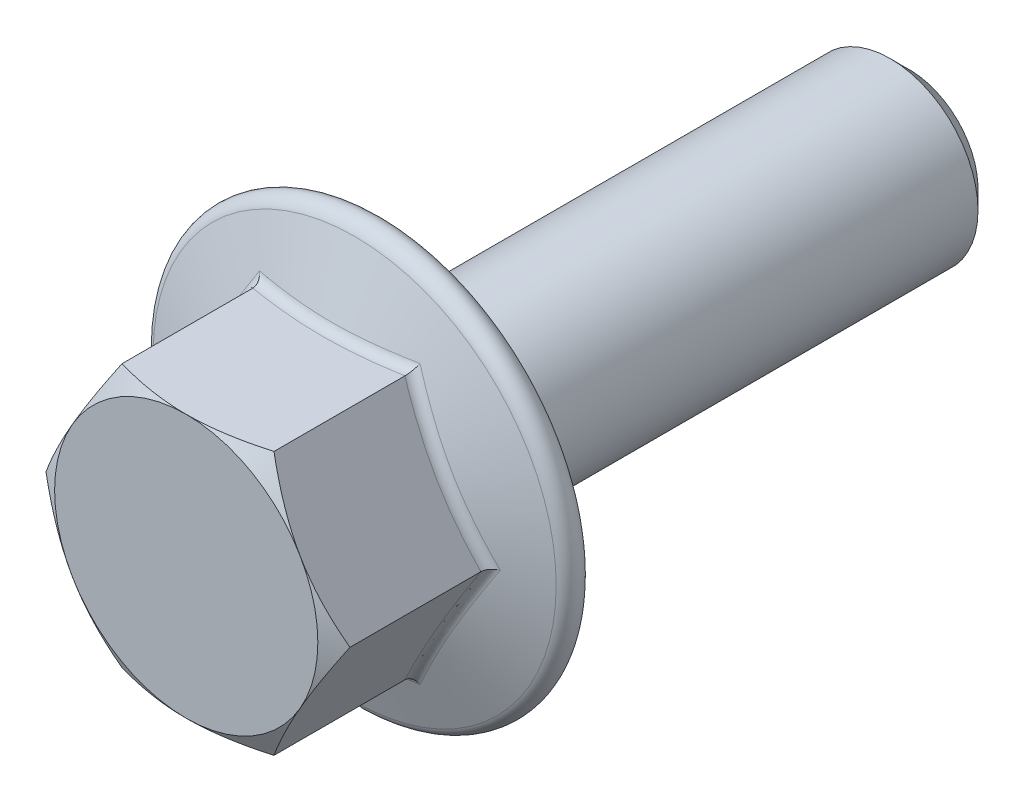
ISO-10303-21;
HEADER;
FILE_DESCRIPTION(('STEP AP214'),'2;1');
FILE_NAME('part.step','',(''),(''),'','','');
FILE_SCHEMA(('AUTOMOTIVE_DESIGN { 1 0 10303 214 1 1 1 1 }'));
ENDSEC;
DATA;
#1=APPLICATION_CONTEXT('core data for automotive mechanical design processes');
#2=APPLICATION_PROTOCOL_DEFINITION('international standard','automotive_design',2000,#1);
#3=PRODUCT_CONTEXT('',#1,'mechanical');
#4=PRODUCT('Part','Part','',(#3));
#5=PRODUCT_RELATED_PRODUCT_CATEGORY('part','',(#4));
#6=PRODUCT_DEFINITION_FORMATION('','',#4);
#7=PRODUCT_DEFINITION_CONTEXT('part definition',#1,'design');
#8=PRODUCT_DEFINITION('design','',#6,#7);
#9=PRODUCT_DEFINITION_SHAPE('','',#8);
#10=(LENGTH_UNIT() NAMED_UNIT(*) SI_UNIT(.MILLI.,.METRE.));
#11=(NAMED_UNIT(*) PLANE_ANGLE_UNIT() SI_UNIT($,.RADIAN.));
#12=(NAMED_UNIT(*) SI_UNIT($,.STERADIAN.) SOLID_ANGLE_UNIT());
#13=UNCERTAINTY_MEASURE_WITH_UNIT(LENGTH_MEASURE(1.E-05),#10,'distance_accuracy_value','');
#14=(GEOMETRIC_REPRESENTATION_CONTEXT(3) GLOBAL_UNCERTAINTY_ASSIGNED_CONTEXT((#13)) GLOBAL_UNIT_ASSIGNED_CONTEXT((#10,
#11,#12)) REPRESENTATION_CONTEXT('',''));
#15=CARTESIAN_POINT('',(0.,0.,0.));
#16=DIRECTION('',(0.,0.,1.));
#17=DIRECTION('',(1.,0.,0.));
#18=AXIS2_PLACEMENT_3D('',#15,#16,#17);
#19=CARTESIAN_POINT('',(0.,0.,-19.05));
#20=DIRECTION('',(0.,0.,1.));
#21=DIRECTION('',(1.,0.,0.));
#22=AXIS2_PLACEMENT_3D('',#19,#20,#21);
#23=CONICAL_SURFACE('',#22,2.48759233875,0.785398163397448);
#24=CARTESIAN_POINT('',(0.,0.,-19.05));
#25=DIRECTION('',(0.,0.,-1.));
#26=DIRECTION('',(-1.,0.,0.));
#27=AXIS2_PLACEMENT_3D('',#24,#25,#26);
#28=CIRCLE('',#27,2.48759233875);
#29=CARTESIAN_POINT('',(-2.48759233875,0.,-19.05));
#30=VERTEX_POINT('',#29);
#31=EDGE_CURVE('E11',#30,#30,#28,.T.);
#32=ORIENTED_EDGE('',*,*,#31,.F.);
#33=EDGE_LOOP('',(#32));
#34=FACE_BOUND('',#33,.T.);
#35=CARTESIAN_POINT('',(0.,0.,-18.36259233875));
#36=DIRECTION('',(0.,0.,1.));
#37=DIRECTION('',(-1.,0.,0.));
#38=AXIS2_PLACEMENT_3D('',#35,#36,#37);
#39=CIRCLE('',#38,3.175);
#40=CARTESIAN_POINT('',(-3.175,0.,-18.36259233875));
#41=VERTEX_POINT('',#40);
#42=EDGE_CURVE('E382',#41,#41,#39,.T.);
#43=ORIENTED_EDGE('',*,*,#42,.F.);
#44=EDGE_LOOP('',(#43));
#45=FACE_BOUND('',#44,.T.);
#46=ADVANCED_FACE('F17',(#34,#45),#23,.T.);
#47=CARTESIAN_POINT('',(0.,0.,-0.635));
#48=DIRECTION('',(0.,0.,1.));
#49=DIRECTION('',(1.,0.,0.));
#50=AXIS2_PLACEMENT_3D('',#47,#48,#49);
#51=TOROIDAL_SURFACE('',#50,3.81,0.635);
#52=CARTESIAN_POINT('',(0.,0.,-0.635));
#53=DIRECTION('',(0.,0.,-1.));
#54=DIRECTION('',(1.,0.,0.));
#55=AXIS2_PLACEMENT_3D('',#52,#53,#54);
#56=CIRCLE('',#55,3.175);
#57=CARTESIAN_POINT('',(3.175,0.,-0.635));
#58=VERTEX_POINT('',#57);
#59=EDGE_CURVE('E29',#58,#58,#56,.T.);
#60=ORIENTED_EDGE('',*,*,#59,.F.);
#61=EDGE_LOOP('',(#60));
#62=FACE_BOUND('',#61,.T.);
#63=CARTESIAN_POINT('',(0.,0.,0.));
#64=DIRECTION('',(0.,0.,1.));
#65=DIRECTION('',(1.,0.,0.));
#66=AXIS2_PLACEMENT_3D('',#63,#64,#65);
#67=CIRCLE('',#66,3.81);
#68=CARTESIAN_POINT('',(3.81,0.,0.));
#69=VERTEX_POINT('',#68);
#70=EDGE_CURVE('E176',#69,#69,#67,.T.);
#71=ORIENTED_EDGE('',*,*,#70,.F.);
#72=EDGE_LOOP('',(#71));
#73=FACE_BOUND('',#72,.T.);
#74=ADVANCED_FACE('F19',(#62,#73),#51,.F.);
#75=CARTESIAN_POINT('',(0.,0.,-19.05));
#76=DIRECTION('',(0.,0.,-1.));
#77=DIRECTION('',(0.,-1.,0.));
#78=AXIS2_PLACEMENT_3D('',#75,#76,#77);
#79=PLANE('',#78);
#80=ORIENTED_EDGE('',*,*,#31,.T.);
#81=EDGE_LOOP('',(#80));
#82=FACE_BOUND('',#81,.T.);
#83=ADVANCED_FACE('F911',(#82),#79,.T.);
#84=CARTESIAN_POINT('',(0.,0.,-19.05));
#85=DIRECTION('',(0.,0.,1.));
#86=DIRECTION('',(1.,0.,0.));
#87=AXIS2_PLACEMENT_3D('',#84,#85,#86);
#88=CYLINDRICAL_SURFACE('',#87,3.175);
#89=ORIENTED_EDGE('',*,*,#59,.T.);
#90=EDGE_LOOP('',(#89));
#91=FACE_BOUND('',#90,.T.);
#92=ORIENTED_EDGE('',*,*,#42,.T.);
#93=EDGE_LOOP('',(#92));
#94=FACE_BOUND('',#93,.T.);
#95=ADVANCED_FACE('F409',(#91,#94),#88,.T.);
#96=CARTESIAN_POINT('',(3.00414301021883,4.7625,1.907206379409));
#97=CARTESIAN_POINT('',(2.9534065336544,4.7625,1.63081245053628));
#98=CARTESIAN_POINT('',(2.93842224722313,5.03097714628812,1.54918349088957));
#99=CARTESIAN_POINT('',(2.03334821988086,4.7625,2.08541111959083));
#100=CARTESIAN_POINT('',(2.00467782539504,4.76250000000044,1.8124946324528));
#101=CARTESIAN_POINT('',(1.98346316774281,5.0217280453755,1.72738822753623));
#102=CARTESIAN_POINT('',(0.0293474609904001,4.7625,2.31860425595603));
#103=CARTESIAN_POINT('',(0.0290417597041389,4.76249999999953,2.05595684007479));
#104=CARTESIAN_POINT('',(0.0284941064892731,5.00476911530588,1.9605813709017));
#105=CARTESIAN_POINT('',(-2.00940058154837,4.7625,2.08984697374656));
#106=CARTESIAN_POINT('',(-1.98151206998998,4.76250000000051,1.81697050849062));
#107=CARTESIAN_POINT('',(-1.95990253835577,5.02149923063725,1.73182408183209));
#108=CARTESIAN_POINT('',(-3.00502278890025,4.7625,1.90704486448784));
#109=CARTESIAN_POINT('',(-2.95427437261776,4.7625,1.63064624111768));
#110=CARTESIAN_POINT('',(-2.93928767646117,5.03098552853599,1.54902197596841));
#111=(BOUNDED_SURFACE() B_SPLINE_SURFACE(3,2,((#96,#97,#98),(#99,#100,#101),(#102,#103,#104),
(#105,#106,#107),(#108,#109,#110)),.UNSPECIFIED.,.F.,.F.,.F.) B_SPLINE_SURFACE_WITH_KNOTS((4,1,
4),(3,3),(0.0236066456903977,0.0265504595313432,0.0294942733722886),(0.,1.),
.UNSPECIFIED.) GEOMETRIC_REPRESENTATION_ITEM() RATIONAL_B_SPLINE_SURFACE(((1.,0.804778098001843,
1.),(1.,0.812319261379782,1.),(1.,0.825889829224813,1.),(1.,0.812505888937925,1.),(1.,
0.804771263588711,1.))) REPRESENTATION_ITEM('') SURFACE());
#112=CARTESIAN_POINT('',(2.74962068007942,4.7625,1.95236061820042));
#113=CARTESIAN_POINT('',(2.74962081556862,4.7624999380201,1.94765926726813));
#114=CARTESIAN_POINT('',(2.74967800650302,4.76258451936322,1.94295815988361));
#115=CARTESIAN_POINT('',(2.7499028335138,4.76292434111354,1.93345353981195));
#116=CARTESIAN_POINT('',(2.75007304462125,4.76318356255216,1.92865022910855));
#117=CARTESIAN_POINT('',(2.75052490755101,4.76388193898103,1.91894912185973));
#118=CARTESIAN_POINT('',(2.75080906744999,4.7643251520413,1.91405173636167));
#119=CARTESIAN_POINT('',(2.75149019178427,4.76540038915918,1.90417119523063));
#120=CARTESIAN_POINT('',(2.75188959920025,4.76603651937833,1.89918865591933));
#121=CARTESIAN_POINT('',(2.75280269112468,4.76750607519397,1.88914755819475));
#122=CARTESIAN_POINT('',(2.75331875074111,4.76834362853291,1.88408982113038));
#123=CARTESIAN_POINT('',(2.75446680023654,4.7702239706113,1.87390904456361));
#124=CARTESIAN_POINT('',(2.75510109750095,4.7712708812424,1.86878702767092));
#125=CARTESIAN_POINT('',(2.75648743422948,4.77357721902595,1.85848937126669));
#126=CARTESIAN_POINT('',(2.75724171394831,4.77484073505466,1.85331495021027));
#127=CARTESIAN_POINT('',(2.75886998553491,4.77758677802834,1.84292508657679));
#128=CARTESIAN_POINT('',(2.75974615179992,4.77907333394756,1.83771105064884));
#129=CARTESIAN_POINT('',(2.76162032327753,4.7822710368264,1.82725542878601));
#130=CARTESIAN_POINT('',(2.76262043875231,4.78398612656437,1.82201542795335));
#131=CARTESIAN_POINT('',(2.76474475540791,4.78764544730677,1.81152214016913));
#132=CARTESIAN_POINT('',(2.76587100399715,4.78959350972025,1.80627060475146));
#133=CARTESIAN_POINT('',(2.76825004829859,4.79372214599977,1.79576923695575));
#134=CARTESIAN_POINT('',(2.76950483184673,4.79590641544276,1.79052130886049));
#135=CARTESIAN_POINT('',(2.77214319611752,4.80050966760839,1.78004267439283));
#136=CARTESIAN_POINT('',(2.77352870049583,4.80293218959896,1.77481400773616));
#137=CARTESIAN_POINT('',(2.77643210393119,4.80801241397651,1.76439015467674));
#138=CARTESIAN_POINT('',(2.77795188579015,4.81067347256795,1.75919713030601));
#139=CARTESIAN_POINT('',(2.78112272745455,4.81623120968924,1.74886013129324));
#140=CARTESIAN_POINT('',(2.78277554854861,4.81913106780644,1.74371840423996));
#141=CARTESIAN_POINT('',(2.78622973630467,4.82515989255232,1.73350365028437));
#142=CARTESIAN_POINT('',(2.78803304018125,4.82829175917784,1.72843299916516));
#143=CARTESIAN_POINT('',(2.79173542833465,4.83479730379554,1.71836512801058));
#144=CARTESIAN_POINT('',(2.79363554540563,4.83817391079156,1.71337016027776));
#145=CARTESIAN_POINT('',(2.79608460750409,4.84230074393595,1.70749881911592));
#146=CARTESIAN_POINT('',(2.79649849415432,4.8429911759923,1.70652416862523));
#147=CARTESIAN_POINT('',(2.79754445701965,4.84470253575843,1.70412485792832));
#148=CARTESIAN_POINT('',(2.79818696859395,4.84572500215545,1.70270586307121));
#149=CARTESIAN_POINT('',(2.80075168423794,4.849806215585,1.69711007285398));
#150=CARTESIAN_POINT('',(2.80270904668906,4.8529205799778,1.69298998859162));
#151=CARTESIAN_POINT('',(2.8075226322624,4.86065448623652,1.68312019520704));
#152=CARTESIAN_POINT('',(2.81040184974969,4.86534301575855,1.67743544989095));
#153=CARTESIAN_POINT('',(2.81509822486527,4.87311226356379,1.66848177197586));
#154=CARTESIAN_POINT('',(2.81689439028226,4.87611163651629,1.66513066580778));
#155=CARTESIAN_POINT('',(2.8207312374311,4.88257314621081,1.65813037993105));
#156=CARTESIAN_POINT('',(2.82277522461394,4.88604738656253,1.65449415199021));
#157=CARTESIAN_POINT('',(2.82711521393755,4.89348537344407,1.64697222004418));
#158=CARTESIAN_POINT('',(2.8294148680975,4.89746184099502,1.64310120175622));
#159=CARTESIAN_POINT('',(2.83427541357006,4.90592853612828,1.63516600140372));
#160=CARTESIAN_POINT('',(2.83684043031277,4.91043176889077,1.6311182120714));
#161=CARTESIAN_POINT('',(2.84224216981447,4.91997174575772,1.62289355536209));
#162=CARTESIAN_POINT('',(2.84508352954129,4.92502140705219,1.61873470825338));
#163=CARTESIAN_POINT('',(2.85104981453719,4.9356673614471,1.61035927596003));
#164=CARTESIAN_POINT('',(2.85417991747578,4.94127608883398,1.60616217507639));
#165=CARTESIAN_POINT('',(2.86073678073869,4.95304448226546,1.59778786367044));
#166=CARTESIAN_POINT('',(2.86416925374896,4.95921569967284,1.59363135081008));
#167=CARTESIAN_POINT('',(2.87134498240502,4.97210247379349,1.58542049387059));
#168=CARTESIAN_POINT('',(2.8750944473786,4.97882831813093,1.58138771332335));
#169=CARTESIAN_POINT('',(2.88291903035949,4.99280509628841,1.57350933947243));
#170=CARTESIAN_POINT('',(2.88700078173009,5.00006472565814,1.56968575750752));
#171=CARTESIAN_POINT('',(2.89550501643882,5.01507565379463,1.56230975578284));
#172=CARTESIAN_POINT('',(2.89993444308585,5.02283379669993,1.55877925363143));
#173=CARTESIAN_POINT('',(2.90444610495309,5.03064822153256,1.55549602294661));
#174=B_SPLINE_CURVE_WITH_KNOTS('',3,(#112,#113,#114,#115,#116,#117,#118,#119,#120,#121,#122,
#123,#124,#125,#126,#127,#128,#129,#130,#131,#132,#133,#134,#135,#136,#137,#138,#139,#140,#141,
#142,#143,#144,#145,#146,#147,#148,#149,#150,#151,#152,#153,#154,#155,#156,#157,#158,#159,#160,
#161,#162,#163,#164,#165,#166,#167,#168,#169,#170,#171,#172,#173),.UNSPECIFIED.,.F.,.F.,(4,2,2,
2,2,2,2,2,2,2,2,2,2,2,2,2,2,2,2,2,2,2,2,2,2,2,2,2,2,2,4),(0.,0.0141026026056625,
0.0285380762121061,0.0433104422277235,0.0584223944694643,0.0738753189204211,0.0896693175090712,
0.105803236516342,0.122274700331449,0.139080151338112,0.156214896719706,0.173673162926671,
0.191448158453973,0.209532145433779,0.227916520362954,0.246591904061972,0.265548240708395,
0.269340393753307,0.274929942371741,0.291496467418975,0.315220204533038,0.329746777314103,
0.346029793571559,0.364047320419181,0.38377009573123,0.405160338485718,0.428170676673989,
0.452743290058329,0.478809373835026,0.506289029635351,0.53509167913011),.UNSPECIFIED.);
#175=CARTESIAN_POINT('',(2.74963065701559,4.7625,1.95241851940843));
#176=VERTEX_POINT('',#175);
#177=CARTESIAN_POINT('',(2.9044462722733,5.03064851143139,1.55549694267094));
#178=VERTEX_POINT('',#177);
#179=EDGE_CURVE('E431',#176,#178,#174,.T.);
#180=CARTESIAN_POINT('',(2.90444610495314,5.03064822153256,1.5554960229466));
#181=CARTESIAN_POINT('',(2.66786642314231,5.02836223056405,1.59925511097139));
#182=CARTESIAN_POINT('',(2.43049814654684,5.02613602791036,1.6390915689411));
#183=CARTESIAN_POINT('',(1.95346492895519,5.0220176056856,1.70958166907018));
#184=CARTESIAN_POINT('',(1.71379464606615,5.0201267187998,1.74019899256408));
#185=CARTESIAN_POINT('',(1.2325436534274,5.01690966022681,1.79062703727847));
#186=CARTESIAN_POINT('',(0.990959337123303,5.01558524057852,1.81040428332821));
#187=CARTESIAN_POINT('',(0.50629980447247,5.01373178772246,1.83751973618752));
#188=CARTESIAN_POINT('',(0.263222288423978,5.01320525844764,1.84481879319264));
#189=CARTESIAN_POINT('',(-0.223907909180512,5.01317658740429,1.84537012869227));
#190=CARTESIAN_POINT('',(-0.467960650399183,5.01367849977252,1.83856681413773));
#191=CARTESIAN_POINT('',(-0.956345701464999,5.01548595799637,1.81234367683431));
#192=CARTESIAN_POINT('',(-1.20067512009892,5.0167947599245,1.79287271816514));
#193=CARTESIAN_POINT('',(-1.6889247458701,5.01999690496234,1.74272858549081));
#194=CARTESIAN_POINT('',(-1.93284126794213,5.02189206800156,1.71202047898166));
#195=CARTESIAN_POINT('',(-2.41960068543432,5.02604957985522,1.64077885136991));
#196=CARTESIAN_POINT('',(-2.66244152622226,5.02831245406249,1.60023122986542));
#197=CARTESIAN_POINT('',(-2.90444596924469,5.03064798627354,1.55549527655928));
#198=B_SPLINE_CURVE_WITH_KNOTS('',3,(#180,#181,#182,#183,#184,#185,#186,#187,#188,#189,#190,
#191,#192,#193,#194,#195,#196,#197),.UNSPECIFIED.,.F.,.F.,(4,2,2,2,2,2,2,2,4),(0.,
0.72186998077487,1.44654763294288,2.17345072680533,2.90263029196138,3.63468982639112,
4.36972298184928,5.10706079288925,5.84546154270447),.UNSPECIFIED.);
#199=CARTESIAN_POINT('',(-2.9044462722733,5.03064851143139,1.55549694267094));
#200=VERTEX_POINT('',#199);
#201=EDGE_CURVE('E295',#200,#178,#198,.F.);
#202=CARTESIAN_POINT('',(-2.90444596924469,5.03064798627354,1.55549527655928));
#203=CARTESIAN_POINT('',(-2.89992061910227,5.02280985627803,1.55878823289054));
#204=CARTESIAN_POINT('',(-2.89547811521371,5.01502826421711,1.5623299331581));
#205=CARTESIAN_POINT('',(-2.88695033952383,4.99997402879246,1.56972985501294));
#206=CARTESIAN_POINT('',(-2.88285804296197,4.99269446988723,1.57356592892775));
#207=CARTESIAN_POINT('',(-2.87501475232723,4.97868169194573,1.58146999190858));
#208=CARTESIAN_POINT('',(-2.87125705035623,4.97193968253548,1.585515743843));
#209=CARTESIAN_POINT('',(-2.8640670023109,4.95902452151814,1.59375242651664));
#210=CARTESIAN_POINT('',(-2.86062838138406,4.95284096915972,1.59792158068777));
#211=CARTESIAN_POINT('',(-2.85406116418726,4.94105177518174,1.60632028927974));
#212=CARTESIAN_POINT('',(-2.85092679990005,4.93543445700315,1.61052895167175));
#213=CARTESIAN_POINT('',(-2.84495374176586,4.92477499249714,1.61892593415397));
#214=CARTESIAN_POINT('',(-2.84210982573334,4.91972028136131,1.62309459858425));
#215=CARTESIAN_POINT('',(-2.83670455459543,4.91017359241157,1.63133673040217));
#216=CARTESIAN_POINT('',(-2.83413852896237,4.90566856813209,1.63539203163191));
#217=CARTESIAN_POINT('',(-2.82927740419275,4.89720134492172,1.6433396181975));
#218=CARTESIAN_POINT('',(-2.8269781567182,4.89322601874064,1.64721539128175));
#219=CARTESIAN_POINT('',(-2.82264029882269,4.88579302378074,1.65474382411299));
#220=CARTESIAN_POINT('',(-2.82059802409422,4.88232252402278,1.6583817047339));
#221=CARTESIAN_POINT('',(-2.81676583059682,4.87587087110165,1.6653820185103));
#222=CARTESIAN_POINT('',(-2.81497260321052,4.87287752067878,1.66873143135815));
#223=CARTESIAN_POINT('',(-2.81028884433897,4.86513269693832,1.67767018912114));
#224=CARTESIAN_POINT('',(-2.80741895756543,4.86046203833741,1.68334094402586));
#225=CARTESIAN_POINT('',(-2.80262833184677,4.8527707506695,1.69316843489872));
#226=CARTESIAN_POINT('',(-2.80068476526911,4.84968088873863,1.69726017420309));
#227=CARTESIAN_POINT('',(-2.79814121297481,4.84563831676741,1.70280727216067));
#228=CARTESIAN_POINT('',(-2.79750705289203,4.84463051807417,1.70420677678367));
#229=CARTESIAN_POINT('',(-2.79647889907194,4.84295011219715,1.70656369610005));
#230=CARTESIAN_POINT('',(-2.7960743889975,4.84227604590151,1.70751546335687));
#231=CARTESIAN_POINT('',(-2.79363214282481,4.8381648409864,1.71336472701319));
#232=CARTESIAN_POINT('',(-2.79173252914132,4.83478686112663,1.71836134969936));
#233=CARTESIAN_POINT('',(-2.78802976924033,4.82827937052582,1.72843199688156));
#234=CARTESIAN_POINT('',(-2.78622560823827,4.82514691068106,1.7335037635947));
#235=CARTESIAN_POINT('',(-2.78277027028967,4.81911709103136,1.74372061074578));
#236=CARTESIAN_POINT('',(-2.78111714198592,4.81621682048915,1.74886330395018));
#237=CARTESIAN_POINT('',(-2.77794570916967,4.81065856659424,1.75920196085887));
#238=CARTESIAN_POINT('',(-2.77642563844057,4.80799739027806,1.7643956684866));
#239=CARTESIAN_POINT('',(-2.77352179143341,4.80291716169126,1.77482062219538));
#240=CARTESIAN_POINT('',(-2.77213612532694,4.80049474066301,1.78004969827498));
#241=CARTESIAN_POINT('',(-2.7694975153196,4.79589189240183,1.79052886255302));
#242=CARTESIAN_POINT('',(-2.76824264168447,4.79370791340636,1.79577690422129));
#243=CARTESIAN_POINT('',(-2.7658634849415,4.78958001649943,1.80627820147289));
#244=CARTESIAN_POINT('',(-2.76473720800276,4.78763239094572,1.81152954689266));
#245=CARTESIAN_POINT('',(-2.76261288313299,4.78397406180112,1.82202215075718));
#246=CARTESIAN_POINT('',(-2.76161278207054,4.78225951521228,1.82726165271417));
#247=CARTESIAN_POINT('',(-2.75973867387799,4.77906297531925,1.83771597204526));
#248=CARTESIAN_POINT('',(-2.75886255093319,4.77757702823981,1.84292920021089));
#249=CARTESIAN_POINT('',(-2.75723438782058,4.77483223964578,1.85331714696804));
#250=CARTESIAN_POINT('',(-2.75648016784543,4.77356935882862,1.85849045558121));
#251=CARTESIAN_POINT('',(-2.75509396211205,4.7712642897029,1.86878559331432));
#252=CARTESIAN_POINT('',(-2.75445973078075,4.77021800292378,1.87390620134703));
#253=CARTESIAN_POINT('',(-2.75331181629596,4.76833887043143,1.88408387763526));
#254=CARTESIAN_POINT('',(-2.75279582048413,4.76750189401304,1.88913992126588));
#255=CARTESIAN_POINT('',(-2.75188285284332,4.76603342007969,1.89917736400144));
#256=CARTESIAN_POINT('',(-2.75148350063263,4.76539778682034,1.90415794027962));
#257=CARTESIAN_POINT('',(-2.75080247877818,4.7643234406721,1.9140343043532));
#258=CARTESIAN_POINT('',(-2.75051836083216,4.76388061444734,1.9189294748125));
#259=CARTESIAN_POINT('',(-2.75006657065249,4.76318288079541,1.92862592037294));
#260=CARTESIAN_POINT('',(-2.74989638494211,4.76292390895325,1.93342678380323));
#261=CARTESIAN_POINT('',(-2.74967159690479,4.76258443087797,1.94292629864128));
#262=CARTESIAN_POINT('',(-2.74961441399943,4.76249993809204,1.94762474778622));
#263=CARTESIAN_POINT('',(-2.74961427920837,4.7625,1.95232344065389));
#264=B_SPLINE_CURVE_WITH_KNOTS('',3,(#202,#203,#204,#205,#206,#207,#208,#209,#210,#211,#212,
#213,#214,#215,#216,#217,#218,#219,#220,#221,#222,#223,#224,#225,#226,#227,#228,#229,#230,#231,
#232,#233,#234,#235,#236,#237,#238,#239,#240,#241,#242,#243,#244,#245,#246,#247,#248,#249,#250,
#251,#252,#253,#254,#255,#256,#257,#258,#259,#260,#261,#262,#263),.UNSPECIFIED.,.F.,.F.,(4,2,2,
2,2,2,2,2,2,2,2,2,2,2,2,2,2,2,2,2,2,2,2,2,2,2,2,2,2,2,4),(0.,0.028889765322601,
0.0564464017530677,0.0825786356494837,0.107206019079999,0.130259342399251,0.151680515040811,
0.171422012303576,0.18944599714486,0.205723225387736,0.220231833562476,0.243883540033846,
0.260330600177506,0.265842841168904,0.269546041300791,0.28850794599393,0.307187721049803,
0.325575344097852,0.343661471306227,0.361437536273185,0.378895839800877,0.396029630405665,
0.41283317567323,0.429301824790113,0.445432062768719,0.46122155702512,0.476669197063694,
0.49177512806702,0.506540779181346,0.520968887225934,0.535063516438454),.UNSPECIFIED.);
#265=CARTESIAN_POINT('',(-2.74963065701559,4.7625,1.95241851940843));
#266=VERTEX_POINT('',#265);
#267=EDGE_CURVE('E385',#200,#266,#264,.T.);
#268=CARTESIAN_POINT('',(2.74963065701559,4.7625,1.95241851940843));
#269=CARTESIAN_POINT('',(1.83970066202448,4.7625,2.10855565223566));
#270=CARTESIAN_POINT('',(-7.12440748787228E-05,4.7625,2.29770837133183));
#271=CARTESIAN_POINT('',(-1.83970666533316,4.7625,2.10855462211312));
#272=CARTESIAN_POINT('',(-2.74963065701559,4.7625,1.95241851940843));
#273=(BOUNDED_CURVE() B_SPLINE_CURVE(3,(#268,#269,#270,#271,#272),.UNSPECIFIED.,.F.,
.F.) B_SPLINE_CURVE_WITH_KNOTS((4,1,4),(0.,0.00276107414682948,0.00552214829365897),
.UNSPECIFIED.) CURVE() GEOMETRIC_REPRESENTATION_ITEM() RATIONAL_B_SPLINE_CURVE((1.,1.,1.,1.,1.)) REPRESENTATION_ITEM(''));
#274=EDGE_CURVE('E450',#176,#266,#273,.T.);
#275=ORIENTED_EDGE('',*,*,#179,.T.);
#276=ORIENTED_EDGE('',*,*,#201,.F.);
#277=ORIENTED_EDGE('',*,*,#267,.T.);
#278=ORIENTED_EDGE('',*,*,#274,.F.);
#279=EDGE_LOOP('',(#275,#276,#277,#278));
#280=FACE_BOUND('',#279,.T.);
#281=ADVANCED_FACE('F397',(#280),#111,.F.);
#282=CARTESIAN_POINT('',(-2.62237527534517,4.98291278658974,1.90720667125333));
#283=CARTESIAN_POINT('',(-2.64774350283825,4.93897372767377,1.63081275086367));
#284=CARTESIAN_POINT('',(-2.88774365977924,5.06023552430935,1.5491837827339));
#285=CARTESIAN_POINT('',(-3.10775035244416,4.14221849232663,2.08540314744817));
#286=CARTESIAN_POINT('',(-3.12208624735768,4.1173879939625,1.81248658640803));
#287=CARTESIAN_POINT('',(-3.3571916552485,4.22863039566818,1.72738025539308));
#288=CARTESIAN_POINT('',(-4.10963922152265,2.40689606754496,2.31860464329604));
#289=CARTESIAN_POINT('',(-4.10979487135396,2.40662647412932,2.05595720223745));
#290=CARTESIAN_POINT('',(-4.31988064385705,2.52728544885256,1.96058175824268));
#291=CARTESIAN_POINT('',(-5.12912926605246,0.641087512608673,2.08985327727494));
#292=CARTESIAN_POINT('',(-5.11518556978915,0.665238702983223,1.81697686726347));
#293=CARTESIAN_POINT('',(-5.32868015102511,0.813453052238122,1.73183038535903));
#294=CARTESIAN_POINT('',(-5.62695801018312,-0.221177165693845,1.90704463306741));
#295=CARTESIAN_POINT('',(-5.60158379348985,-0.177227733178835,1.6306460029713));
#296=CARTESIAN_POINT('',(-5.82660574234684,-0.0300061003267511,1.54902174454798));
#297=(BOUNDED_SURFACE() B_SPLINE_SURFACE(3,2,((#282,#283,#284),(#285,#286,#287),(#288,#289,
#290),(#291,#292,#293),(#294,#295,#296)),.UNSPECIFIED.,.F.,.F.,
.F.) B_SPLINE_SURFACE_WITH_KNOTS((4,1,4),(3,3),(0.0236029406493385,0.0265466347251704,
0.0294903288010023),(0.,1.),
.UNSPECIFIED.) GEOMETRIC_REPRESENTATION_ITEM() RATIONAL_B_SPLINE_SURFACE(((1.,0.804778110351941,
1.),(1.,0.812318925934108,1.),(1.,0.825889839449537,1.),(1.,0.812506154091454,1.),(1.,
0.804771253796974,1.))) REPRESENTATION_ITEM('') SURFACE());
#298=CARTESIAN_POINT('',(-5.80889193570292,-1.49690616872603E-10,1.55549526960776));
#299=CARTESIAN_POINT('',(-5.79984149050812,3.02754319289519E-09,1.55878813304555));
#300=CARTESIAN_POINT('',(-5.79088142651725,-4.34682989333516E-05,1.56232972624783));
#301=CARTESIAN_POINT('',(-5.77358063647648,-0.000185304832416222,1.56972941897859));
#302=CARTESIAN_POINT('',(-5.76523040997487,-0.000281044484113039,1.57356537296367));
#303=CARTESIAN_POINT('',(-5.74917371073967,-0.000494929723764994,1.58146918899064));
#304=CARTESIAN_POINT('',(-5.74145627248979,-0.00061166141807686,1.5855148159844));
#305=CARTESIAN_POINT('',(-5.72667667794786,-0.000842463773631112,1.59375124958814));
#306=CARTESIAN_POINT('',(-5.71960237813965,-0.000956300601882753,1.59792028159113));
#307=CARTESIAN_POINT('',(-5.70610923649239,-0.00116351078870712,1.60631875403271));
#308=CARTESIAN_POINT('',(-5.69967739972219,-0.00125772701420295,1.61052730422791));
#309=CARTESIAN_POINT('',(-5.68745963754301,-0.00141463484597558,1.61892407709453));
#310=CARTESIAN_POINT('',(-5.68166022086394,-0.00147908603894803,1.62309264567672));
#311=CARTESIAN_POINT('',(-5.67068997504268,-0.00157132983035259,1.63133460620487));
#312=CARTESIAN_POINT('',(-5.66550551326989,-0.0016016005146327,1.63538983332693));
#313=CARTESIAN_POINT('',(-5.65574212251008,-0.00162536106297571,1.64333729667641));
#314=CARTESIAN_POINT('',(-5.65114975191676,-0.00162182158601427,1.64721302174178));
#315=CARTESIAN_POINT('',(-5.64254360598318,-0.00158163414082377,1.65474138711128));
#316=CARTESIAN_POINT('',(-5.63851688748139,-0.00154822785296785,1.65837924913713));
#317=CARTESIAN_POINT('',(-5.63101339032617,-0.00145528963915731,1.66537955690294));
#318=CARTESIAN_POINT('',(-5.62752439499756,-0.00139899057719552,1.66872898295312));
#319=CARTESIAN_POINT('',(-5.61847504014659,-0.00121516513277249,1.67766787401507));
#320=CARTESIAN_POINT('',(-5.61299499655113,-0.00106511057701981,1.68333875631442));
#321=CARTESIAN_POINT('',(-5.60393837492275,-0.000761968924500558,1.6931666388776));
#322=CARTESIAN_POINT('',(-5.60029042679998,-0.000623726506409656,1.69725864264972));
#323=CARTESIAN_POINT('',(-5.59551726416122,-0.000442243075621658,1.70280619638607));
#324=CARTESIAN_POINT('',(-5.59432724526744,-0.000396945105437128,1.70420588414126));
#325=CARTESIAN_POINT('',(-5.59235755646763,-0.000346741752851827,1.70656320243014));
#326=CARTESIAN_POINT('',(-5.59157136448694,-0.000333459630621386,1.70751518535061));
#327=CARTESIAN_POINT('',(-5.58678966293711,-0.000274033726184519,1.71336466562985));
#328=CARTESIAN_POINT('',(-5.58291443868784,-0.000317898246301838,1.7183612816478));
#329=CARTESIAN_POINT('',(-5.57542740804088,-0.000364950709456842,1.72843191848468));
#330=CARTESIAN_POINT('',(-5.57181254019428,-0.000368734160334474,1.73350368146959));
#331=CARTESIAN_POINT('',(-5.56486289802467,-0.000391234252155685,1.74372052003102));
#332=CARTESIAN_POINT('',(-5.56152462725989,-0.000409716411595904,1.74886320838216));
#333=CARTESIAN_POINT('',(-5.5551253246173,-0.000442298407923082,1.75920185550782));
#334=CARTESIAN_POINT('',(-5.55206064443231,-0.000456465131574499,1.76439555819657));
#335=CARTESIAN_POINT('',(-5.54620911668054,-0.000481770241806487,1.77482050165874));
#336=CARTESIAN_POINT('',(-5.54341840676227,-0.000492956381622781,1.78004957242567));
#337=CARTESIAN_POINT('',(-5.53811292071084,-0.000509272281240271,1.79052872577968));
#338=CARTESIAN_POINT('',(-5.53559410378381,-0.000514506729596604,1.79577676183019));
#339=CARTESIAN_POINT('',(-5.53082966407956,-0.000518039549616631,1.80627804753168));
#340=CARTESIAN_POINT('',(-5.52857983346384,-0.000516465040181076,1.81152938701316));
#341=CARTESIAN_POINT('',(-5.52434946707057,-0.000505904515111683,1.82202197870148));
#342=CARTESIAN_POINT('',(-5.52236457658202,-0.000497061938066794,1.8272614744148));
#343=CARTESIAN_POINT('',(-5.51865923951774,-0.000472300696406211,1.83771578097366));
#344=CARTESIAN_POINT('',(-5.51693431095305,-0.000456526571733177,1.84292900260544));
#345=CARTESIAN_POINT('',(-5.51374317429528,-0.000418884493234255,1.85331693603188));
#346=CARTESIAN_POINT('',(-5.5122723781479,-0.000397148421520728,1.85849023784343));
#347=CARTESIAN_POINT('',(-5.5095830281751,-0.000349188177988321,1.86878536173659));
#348=CARTESIAN_POINT('',(-5.50835980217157,-0.00032306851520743,1.87390596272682));
#349=CARTESIAN_POINT('',(-5.50615846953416,-0.000268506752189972,1.88408362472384));
#350=CARTESIAN_POINT('',(-5.50517562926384,-0.000240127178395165,1.88913966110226));
#351=CARTESIAN_POINT('',(-5.50344741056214,-0.000183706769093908,1.89917708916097));
#352=CARTESIAN_POINT('',(-5.50269726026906,-0.000155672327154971,1.90415765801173));
#353=CARTESIAN_POINT('',(-5.50142633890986,-0.000103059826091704,1.91403400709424));
#354=CARTESIAN_POINT('',(-5.50090078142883,-7.8418133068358E-05,1.91892916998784));
#355=CARTESIAN_POINT('',(-5.50007063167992,-3.60208385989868E-05,1.92862560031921));
#356=CARTESIAN_POINT('',(-5.49976126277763,-1.81206978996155E-05,1.93342645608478));
#357=CARTESIAN_POINT('',(-5.49935487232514,6.81363339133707E-06,1.94292595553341));
#358=CARTESIAN_POINT('',(-5.49925310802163,1.40894081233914E-05,1.94762439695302));
#359=CARTESIAN_POINT('',(-5.49925309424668,1.42370843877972E-05,1.95232308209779));
#360=B_SPLINE_CURVE_WITH_KNOTS('',3,(#298,#299,#300,#301,#302,#303,#304,#305,#306,#307,#308,
#309,#310,#311,#312,#313,#314,#315,#316,#317,#318,#319,#320,#321,#322,#323,#324,#325,#326,#327,
#328,#329,#330,#331,#332,#333,#334,#335,#336,#337,#338,#339,#340,#341,#342,#343,#344,#345,#346,
#347,#348,#349,#350,#351,#352,#353,#354,#355,#356,#357,#358,#359),.UNSPECIFIED.,.F.,.F.,(4,2,2,
2,2,2,2,2,2,2,2,2,2,2,2,2,2,2,2,2,2,2,2,2,2,2,2,2,2,2,4),(0.,0.0288889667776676,
0.0564448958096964,0.0825765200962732,0.107203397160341,0.130256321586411,0.151677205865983,
0.171418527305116,0.18944244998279,0.205719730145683,0.220228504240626,0.243880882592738,
0.260329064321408,0.265842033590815,0.269546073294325,0.28850796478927,0.307187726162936,
0.325575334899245,0.343661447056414,0.361437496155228,0.378895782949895,0.396029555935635,
0.412833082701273,0.42930171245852,0.445431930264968,0.461221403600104,0.476669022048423,
0.491774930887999,0.506540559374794,0.520968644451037,0.535063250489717),.UNSPECIFIED.);
#361=CARTESIAN_POINT('',(-5.8088925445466,0.,1.55549694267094));
#362=VERTEX_POINT('',#361);
#363=CARTESIAN_POINT('',(-5.49926131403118,0.,1.95241851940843));
#364=VERTEX_POINT('',#363);
#365=EDGE_CURVE('E436',#362,#364,#360,.T.);
#366=CARTESIAN_POINT('',(-2.74963065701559,4.7625,1.95241851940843));
#367=CARTESIAN_POINT('',(-3.20459414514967,3.97448012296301,2.10855513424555));
#368=CARTESIAN_POINT('',(-4.12444598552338,2.38125,2.29770837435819));
#369=CARTESIAN_POINT('',(-5.0442978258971,0.788019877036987,2.10855513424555));
#370=CARTESIAN_POINT('',(-5.49926131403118,0.,1.95241851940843));
#371=(BOUNDED_CURVE() B_SPLINE_CURVE(3,(#366,#367,#368,#369,#370),.UNSPECIFIED.,.F.,
.F.) B_SPLINE_CURVE_WITH_KNOTS((4,1,4),(0.,0.00276103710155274,0.00552207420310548),
.UNSPECIFIED.) CURVE() GEOMETRIC_REPRESENTATION_ITEM() RATIONAL_B_SPLINE_CURVE((1.,1.,1.,1.,1.)) REPRESENTATION_ITEM(''));
#372=EDGE_CURVE('E231',#266,#364,#371,.T.);
#373=CARTESIAN_POINT('',(-2.90444610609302,5.03064822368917,1.55549602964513));
#374=CARTESIAN_POINT('',(-3.0207493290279,4.82463339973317,1.5992527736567));
#375=CARTESIAN_POINT('',(-3.13749847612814,4.61796564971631,1.63908814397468));
#376=CARTESIAN_POINT('',(-3.37243313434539,4.202810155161,1.70957708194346));
#377=CARTESIAN_POINT('',(-3.49062246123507,3.99431846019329,1.7401944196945));
#378=CARTESIAN_POINT('',(-3.72844684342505,3.57596035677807,1.79062315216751));
#379=CARTESIAN_POINT('',(-3.84808523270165,3.36609169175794,1.81040093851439));
#380=CARTESIAN_POINT('',(-4.0888003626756,2.94545378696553,1.8375179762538));
#381=CARTESIAN_POINT('',(-4.20988045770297,2.73468379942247,1.84481765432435));
#382=CARTESIAN_POINT('',(-4.45342115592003,2.31280139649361,1.84537083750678));
#383=CARTESIAN_POINT('',(-4.57588534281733,2.10169098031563,1.83856807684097));
#384=CARTESIAN_POINT('',(-4.82165335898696,1.679623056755,1.81234635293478));
#385=CARTESIAN_POINT('',(-4.94495857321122,1.46866971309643,1.79287585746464));
#386=CARTESIAN_POINT('',(-5.19187172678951,1.04740780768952,1.74273232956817));
#387=CARTESIAN_POINT('',(-5.31547939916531,0.837103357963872,1.71202427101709));
#388=CARTESIAN_POINT('',(-5.56247417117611,0.417610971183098,1.64078173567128));
#389=CARTESIAN_POINT('',(-5.68586070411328,0.208425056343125,1.60023329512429));
#390=CARTESIAN_POINT('',(-5.80889193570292,-1.49691086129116E-10,1.55549526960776));
#391=B_SPLINE_CURVE_WITH_KNOTS('',3,(#373,#374,#375,#376,#377,#378,#379,#380,#381,#382,#383,
#384,#385,#386,#387,#388,#389,#390),.UNSPECIFIED.,.F.,.F.,(4,2,2,2,2,2,2,2,4),(0.,
0.721827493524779,1.44645604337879,2.17331879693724,2.90248248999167,3.6345609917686,
4.36963636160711,5.10702266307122,5.84546151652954),.UNSPECIFIED.);
#392=EDGE_CURVE('E362',#362,#200,#391,.F.);
#393=ORIENTED_EDGE('',*,*,#365,.T.);
#394=ORIENTED_EDGE('',*,*,#372,.F.);
#395=ORIENTED_EDGE('',*,*,#267,.F.);
#396=ORIENTED_EDGE('',*,*,#392,.F.);
#397=EDGE_LOOP('',(#393,#394,#395,#396));
#398=FACE_BOUND('',#397,.T.);
#399=ADVANCED_FACE('F257',(#398),#297,.F.);
#400=CARTESIAN_POINT('',(5.62651669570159,-0.220412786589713,1.90720667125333));
#401=CARTESIAN_POINT('',(5.60114846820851,-0.176473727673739,1.63081275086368));
#402=CARTESIAN_POINT('',(5.82616434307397,-0.0292583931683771,1.5491837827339));
#403=CARTESIAN_POINT('',(5.14114161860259,0.620281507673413,2.08540314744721));
#404=CARTESIAN_POINT('',(5.12680572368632,0.645112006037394,1.81248658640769));
#405=CARTESIAN_POINT('',(5.34069717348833,0.793098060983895,1.72738025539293));
#406=CARTESIAN_POINT('',(4.139252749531,2.35560393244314,2.31860464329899));
#407=CARTESIAN_POINT('',(4.13909709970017,2.35587352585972,2.05595720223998));
#408=CARTESIAN_POINT('',(4.34863372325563,2.47748365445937,1.96058175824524));
#409=CARTESIAN_POINT('',(3.11976270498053,4.12141248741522,2.08985327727));
#410=CARTESIAN_POINT('',(3.1337064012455,4.0972612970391,1.81697686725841));
#411=CARTESIAN_POINT('',(3.36881108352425,4.20804585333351,1.73183038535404));
#412=CARTESIAN_POINT('',(2.62193396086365,4.98367716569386,1.9070446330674));
#413=CARTESIAN_POINT('',(2.64730817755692,4.93972773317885,1.6306460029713));
#414=CARTESIAN_POINT('',(2.88731682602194,5.06099164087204,1.54902174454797));
#415=(BOUNDED_SURFACE() B_SPLINE_SURFACE(3,2,((#400,#401,#402),(#403,#404,#405),(#406,#407,
#408),(#409,#410,#411),(#412,#413,#414)),.UNSPECIFIED.,.F.,.F.,
.F.) B_SPLINE_SURFACE_WITH_KNOTS((4,1,4),(3,3),(0.0236029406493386,0.0265466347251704,
0.0294903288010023),(0.,1.),
.UNSPECIFIED.) GEOMETRIC_REPRESENTATION_ITEM() RATIONAL_B_SPLINE_SURFACE(((1.,0.804778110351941,
1.),(1.,0.812318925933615,1.),(1.,0.82588983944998,1.),(1.,0.812506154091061,1.),(1.,
0.804771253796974,1.))) REPRESENTATION_ITEM('') SURFACE());
#416=CARTESIAN_POINT('',(5.49925635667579,8.58639141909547E-06,1.95236097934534));
#417=CARTESIAN_POINT('',(5.49925637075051,8.43805459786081E-06,1.94765961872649));
#418=CARTESIAN_POINT('',(5.49935821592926,1.20025889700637E-06,1.94295850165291));
#419=CARTESIAN_POINT('',(5.49976492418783,-2.35934960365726E-05,1.93345386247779));
#420=CARTESIAN_POINT('',(5.5000745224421,-4.13889667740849E-05,1.92865054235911));
#421=CARTESIAN_POINT('',(5.50090526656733,-8.35230857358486E-05,1.91894941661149));
#422=CARTESIAN_POINT('',(5.50143118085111,-0.000108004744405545,1.91405202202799));
#423=CARTESIAN_POINT('',(5.50270292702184,-0.000160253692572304,1.90417146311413));
#424=CARTESIAN_POINT('',(5.50345353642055,-0.000188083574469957,1.89918891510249));
#425=CARTESIAN_POINT('',(5.50518275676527,-0.00024406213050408,1.88914780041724));
#426=CARTESIAN_POINT('',(5.50616612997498,-0.000272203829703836,1.88409005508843));
#427=CARTESIAN_POINT('',(5.50836858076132,-0.000326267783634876,1.87390926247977));
#428=CARTESIAN_POINT('',(5.50959238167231,-0.000352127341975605,1.86878723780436));
#429=CARTESIAN_POINT('',(5.51228289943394,-0.000399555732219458,1.85848956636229));
#430=CARTESIAN_POINT('',(5.51375427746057,-0.000421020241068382,1.85331513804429));
#431=CARTESIAN_POINT('',(5.51694655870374,-0.000458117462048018,1.84292526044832));
#432=CARTESIAN_POINT('',(5.51867203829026,-0.000473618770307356,1.83771121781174));
#433=CARTESIAN_POINT('',(5.52237841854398,-0.000497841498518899,1.82725558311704));
#434=CARTESIAN_POINT('',(5.52436378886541,-0.000506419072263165,1.8220155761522));
#435=CARTESIAN_POINT('',(5.52859501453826,-0.000516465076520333,1.81152227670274));
#436=CARTESIAN_POINT('',(5.53084521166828,-0.000517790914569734,1.80627073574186));
#437=CARTESIAN_POINT('',(5.53561024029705,-0.000513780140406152,1.79576935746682));
#438=CARTESIAN_POINT('',(5.53812926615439,-0.000508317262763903,1.79052142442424));
#439=CARTESIAN_POINT('',(5.5434349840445,-0.000491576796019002,1.78004278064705));
#440=CARTESIAN_POINT('',(5.54622570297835,-0.000480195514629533,1.77481410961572));
#441=CARTESIAN_POINT('',(5.55207701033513,-0.000454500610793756,1.76439024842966));
#442=CARTESIAN_POINT('',(5.55514144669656,-0.000440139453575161,1.75919722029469));
#443=CARTESIAN_POINT('',(5.56154001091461,-0.000407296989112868,1.74886021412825));
#444=CARTESIAN_POINT('',(5.56487777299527,-0.000388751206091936,1.74371848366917));
#445=CARTESIAN_POINT('',(5.57182598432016,-0.0003657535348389,1.73350372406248));
#446=CARTESIAN_POINT('',(5.57543991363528,-0.000361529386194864,1.72843307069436));
#447=CARTESIAN_POINT('',(5.58292507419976,-0.000315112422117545,1.71836519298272));
#448=CARTESIAN_POINT('',(5.58679935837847,-0.000272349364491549,1.71337022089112));
#449=CARTESIAN_POINT('',(5.59159768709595,-0.000329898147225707,1.70749906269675));
#450=CARTESIAN_POINT('',(5.59240241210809,-0.000343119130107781,1.70652459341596));
#451=CARTESIAN_POINT('',(5.59440719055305,-0.00039327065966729,1.70412561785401));
#452=CARTESIAN_POINT('',(5.59561379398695,-0.000438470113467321,1.70270677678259));
#453=CARTESIAN_POINT('',(5.60043023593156,-0.000618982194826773,1.69711136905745));
#454=CARTESIAN_POINT('',(5.60410581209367,-0.000756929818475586,1.69299150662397));
#455=CARTESIAN_POINT('',(5.61320997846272,-0.0010586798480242,1.68312204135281));
#456=CARTESIAN_POINT('',(5.61870981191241,-0.00120790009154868,1.67743740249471));
#457=CARTESIAN_POINT('',(5.62778614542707,-0.00139047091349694,1.66848383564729));
#458=CARTESIAN_POINT('',(5.63128170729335,-0.00144631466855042,1.66513274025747));
#459=CARTESIAN_POINT('',(5.638795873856,-0.0015383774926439,1.65813244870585));
#460=CARTESIAN_POINT('',(5.64282661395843,-0.00157140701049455,1.65449620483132));
#461=CARTESIAN_POINT('',(5.65143804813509,-0.00161096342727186,1.64697421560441));
#462=CARTESIAN_POINT('',(5.65603158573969,-0.00161429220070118,1.64310315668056));
#463=CARTESIAN_POINT('',(5.66579423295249,-0.00159030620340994,1.63516785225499));
#464=CARTESIAN_POINT('',(5.67097666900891,-0.00156006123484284,1.63112000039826));
#465=CARTESIAN_POINT('',(5.68193945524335,-0.0014681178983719,1.62289519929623));
#466=CARTESIAN_POINT('',(5.68773331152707,-0.00140397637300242,1.61873627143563));
#467=CARTESIAN_POINT('',(5.69993623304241,-0.00124795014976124,1.61036066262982));
#468=CARTESIAN_POINT('',(5.7063586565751,-0.00115433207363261,1.60616346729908));
#469=CARTESIAN_POINT('',(5.71982899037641,-0.000948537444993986,1.59778895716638));
#470=CARTESIAN_POINT('',(5.72688976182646,-0.000835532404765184,1.5936323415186));
#471=CARTESIAN_POINT('',(5.74163814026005,-0.000606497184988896,1.58542127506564));
#472=CARTESIAN_POINT('',(5.7493377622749,-0.000490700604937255,1.58138838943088));
#473=CARTESIAN_POINT('',(5.76535460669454,-0.000278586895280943,1.57350980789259));
#474=CARTESIAN_POINT('',(5.7736826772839,-0.000183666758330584,1.56968612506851));
#475=CARTESIAN_POINT('',(5.79093501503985,-4.30770143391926E-05,1.56230993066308));
#476=CARTESIAN_POINT('',(5.79986868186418,1.33570842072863E-09,1.55877933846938));
#477=CARTESIAN_POINT('',(5.80889221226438,-4.52243083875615E-11,1.55549602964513));
#478=B_SPLINE_CURVE_WITH_KNOTS('',3,(#416,#417,#418,#419,#420,#421,#422,#423,#424,#425,#426,
#427,#428,#429,#430,#431,#432,#433,#434,#435,#436,#437,#438,#439,#440,#441,#442,#443,#444,#445,
#446,#447,#448,#449,#450,#451,#452,#453,#454,#455,#456,#457,#458,#459,#460,#461,#462,#463,#464,
#465,#466,#467,#468,#469,#470,#471,#472,#473,#474,#475,#476,#477),.UNSPECIFIED.,.F.,.F.,(4,2,2,
2,2,2,2,2,2,2,2,2,2,2,2,2,2,2,2,2,2,2,2,2,2,2,2,2,2,2,4),(0.,0.0141026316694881,
0.0285381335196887,0.043310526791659,0.0584225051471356,0.0738754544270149,0.0896694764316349,
0.105803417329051,0.122274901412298,0.13908037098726,0.156215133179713,0.173673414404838,
0.191448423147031,0.209532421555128,0.227916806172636,0.246592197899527,0.265548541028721,
0.269339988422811,0.274928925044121,0.29149450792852,0.315217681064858,0.329744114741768,
0.346027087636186,0.364044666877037,0.383767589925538,0.405158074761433,0.428168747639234,
0.452741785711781,0.478808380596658,0.506288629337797,0.535091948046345),.UNSPECIFIED.);
#479=CARTESIAN_POINT('',(5.49926131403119,0.,1.95241851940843));
#480=VERTEX_POINT('',#479);
#481=CARTESIAN_POINT('',(5.8088925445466,0.,1.55549694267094));
#482=VERTEX_POINT('',#481);
#483=EDGE_CURVE('E238',#480,#482,#478,.T.);
#484=CARTESIAN_POINT('',(5.80889221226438,-4.52243083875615E-11,1.55549602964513));
#485=CARTESIAN_POINT('',(5.68862975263,0.203728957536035,1.59925277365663));
#486=CARTESIAN_POINT('',(5.56802480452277,0.408170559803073,1.63908814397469));
#487=CARTESIAN_POINT('',(5.32595692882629,0.819207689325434,1.70957708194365));
#488=CARTESIAN_POINT('',(5.20449248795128,1.02580849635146,1.74019441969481));
#489=CARTESIAN_POINT('',(4.96109593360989,1.44094950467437,1.79062315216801));
#490=CARTESIAN_POINT('',(4.83916353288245,1.64949372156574,1.81040093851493));
#491=CARTESIAN_POINT('',(4.59523798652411,2.06827809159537,1.83751797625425));
#492=CARTESIAN_POINT('',(4.47324587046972,2.27852152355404,1.84481765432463));
#493=CARTESIAN_POINT('',(4.22965534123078,2.70037515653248,1.8453708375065));
#494=CARTESIAN_POINT('',(4.10806045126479,2.91198746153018,1.83856807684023));
#495=CARTESIAN_POINT('',(3.86542291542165,3.3358627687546,1.8123463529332));
#496=CARTESIAN_POINT('',(3.74438456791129,3.54812488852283,1.7928758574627));
#497=CARTESIAN_POINT('',(3.50301763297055,3.97258890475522,1.74273232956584));
#498=CARTESIAN_POINT('',(3.38269247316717,4.1847885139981,1.71202427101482));
#499=CARTESIAN_POINT('',(3.14289879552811,4.60843845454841,1.64078173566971));
#500=CARTESIAN_POINT('',(3.02343174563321,4.81988728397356,1.6002332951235));
#501=CARTESIAN_POINT('',(2.90444596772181,5.03064798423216,1.55549526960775));
#502=B_SPLINE_CURVE_WITH_KNOTS('',3,(#484,#485,#486,#487,#488,#489,#490,#491,#492,#493,#494,
#495,#496,#497,#498,#499,#500,#501),.UNSPECIFIED.,.F.,.F.,(4,2,2,2,2,2,2,2,4),(0.,
0.721827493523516,1.44645604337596,2.17331879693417,2.90248248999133,3.63456099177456,
4.36963636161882,5.10702266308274,5.84546151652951),.UNSPECIFIED.);
#503=EDGE_CURVE('E344',#178,#482,#502,.F.);
#504=CARTESIAN_POINT('',(5.49926131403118,0.,1.95241851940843));
#505=CARTESIAN_POINT('',(5.0442978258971,0.788019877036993,2.10855513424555));
#506=CARTESIAN_POINT('',(4.12444598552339,2.38125,2.29770837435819));
#507=CARTESIAN_POINT('',(3.20459414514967,3.97448012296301,2.10855513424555));
#508=CARTESIAN_POINT('',(2.74963065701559,4.7625,1.95241851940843));
#509=(BOUNDED_CURVE() B_SPLINE_CURVE(3,(#504,#505,#506,#507,#508),.UNSPECIFIED.,.F.,
.F.) B_SPLINE_CURVE_WITH_KNOTS((4,1,4),(0.,0.00276103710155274,0.00552207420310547),
.UNSPECIFIED.) CURVE() GEOMETRIC_REPRESENTATION_ITEM() RATIONAL_B_SPLINE_CURVE((1.,1.,1.,1.,1.)) REPRESENTATION_ITEM(''));
#510=EDGE_CURVE('E433',#480,#176,#509,.T.);
#511=ORIENTED_EDGE('',*,*,#483,.T.);
#512=ORIENTED_EDGE('',*,*,#503,.F.);
#513=ORIENTED_EDGE('',*,*,#179,.F.);
#514=ORIENTED_EDGE('',*,*,#510,.F.);
#515=EDGE_LOOP('',(#511,#512,#513,#514));
#516=FACE_BOUND('',#515,.T.);
#517=ADVANCED_FACE('F245',(#516),#415,.F.);
#518=CARTESIAN_POINT('',(-5.6265166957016,0.220412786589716,1.90720667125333));
#519=CARTESIAN_POINT('',(-5.60114846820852,0.176473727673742,1.63081275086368));
#520=CARTESIAN_POINT('',(-5.82616434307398,0.0292583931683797,1.5491837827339));
#521=CARTESIAN_POINT('',(-5.14114161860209,-0.620281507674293,2.08540314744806));
#522=CARTESIAN_POINT('',(-5.12680572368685,-0.645112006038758,1.81248658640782));
#523=CARTESIAN_POINT('',(-5.34069717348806,-0.793098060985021,1.72738025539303));
#524=CARTESIAN_POINT('',(-4.13925274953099,-2.35560393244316,2.31860464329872));
#525=CARTESIAN_POINT('',(-4.13909709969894,-2.35587352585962,2.05595720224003));
#526=CARTESIAN_POINT('',(-4.34863372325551,-2.47748365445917,1.96058175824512));
#527=CARTESIAN_POINT('',(-3.11976270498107,-4.12141248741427,2.08985327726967));
#528=CARTESIAN_POINT('',(-3.13370640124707,-4.09726129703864,1.81697686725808));
#529=CARTESIAN_POINT('',(-3.36881108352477,-4.20804585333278,1.73183038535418));
#530=CARTESIAN_POINT('',(-2.62193396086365,-4.98367716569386,1.90704463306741));
#531=CARTESIAN_POINT('',(-2.64730817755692,-4.93972773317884,1.6306460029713));
#532=CARTESIAN_POINT('',(-2.88731682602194,-5.06099164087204,1.54902174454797));
#533=(BOUNDED_SURFACE() B_SPLINE_SURFACE(3,2,((#518,#519,#520),(#521,#522,#523),(#524,#525,
#526),(#527,#528,#529),(#530,#531,#532)),.UNSPECIFIED.,.F.,.F.,
.F.) B_SPLINE_SURFACE_WITH_KNOTS((4,1,4),(3,3),(0.0236029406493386,0.0265466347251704,
0.0294903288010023),(0.,1.),
.UNSPECIFIED.) GEOMETRIC_REPRESENTATION_ITEM() RATIONAL_B_SPLINE_SURFACE(((1.,0.804778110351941,
1.),(1.,0.812318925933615,1.),(1.,0.825889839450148,1.),(1.,0.812506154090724,1.),(1.,
0.804771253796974,1.))) REPRESENTATION_ITEM('') SURFACE());
#534=CARTESIAN_POINT('',(-2.9044459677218,-5.03064798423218,1.55549526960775));
#535=CARTESIAN_POINT('',(-2.89992074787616,-5.02281006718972,1.55878813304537));
#536=CARTESIAN_POINT('',(-2.89540306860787,-5.01507215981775,1.56232972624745));
#537=CARTESIAN_POINT('',(-2.88662983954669,-5.00016015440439,1.5697294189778));
#538=CARTESIAN_POINT('',(-2.88237181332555,-4.99297651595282,1.57356537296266));
#539=CARTESIAN_POINT('',(-2.87415823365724,-4.97917794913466,1.58146918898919));
#540=CARTESIAN_POINT('',(-2.87019842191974,-4.97255281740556,1.58551481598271));
#541=CARTESIAN_POINT('',(-2.86260874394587,-4.95986871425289,1.59375124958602));
#542=CARTESIAN_POINT('',(-2.85897300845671,-4.95379910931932,1.59792028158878));
#543=CARTESIAN_POINT('',(-2.85204698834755,-4.94221731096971,1.60631875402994));
#544=CARTESIAN_POINT('',(-2.84874947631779,-4.93669428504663,1.61052730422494));
#545=CARTESIAN_POINT('',(-2.84250470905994,-4.92619184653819,1.61892407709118));
#546=CARTESIAN_POINT('',(-2.83954918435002,-4.92120162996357,1.6230926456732));
#547=CARTESIAN_POINT('',(-2.83398417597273,-4.91174724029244,1.63133460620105));
#548=CARTESIAN_POINT('',(-2.83136572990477,-4.90727250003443,1.63538983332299));
#549=CARTESIAN_POINT('',(-2.82646345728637,-4.89882903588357,1.64333729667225));
#550=CARTESIAN_POINT('',(-2.82417033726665,-4.89485015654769,1.64721302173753));
#551=CARTESIAN_POINT('',(-2.81990206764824,-4.88737692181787,1.65474138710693));
#552=CARTESIAN_POINT('',(-2.81791763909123,-4.88387297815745,1.65837924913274));
#553=CARTESIAN_POINT('',(-2.81424637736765,-4.87732828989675,1.66537955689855));
#554=CARTESIAN_POINT('',(-2.81255063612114,-4.87427858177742,1.66872898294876));
#555=CARTESIAN_POINT('',(-2.80818515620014,-4.86634969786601,1.67766787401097));
#556=CARTESIAN_POINT('',(-2.80557508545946,-4.86152881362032,1.68333875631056));
#557=CARTESIAN_POINT('',(-2.8013093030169,-4.85353397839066,1.69316663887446));
#558=CARTESIAN_POINT('',(-2.79960505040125,-4.85030564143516,1.69725864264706));
#559=CARTESIAN_POINT('',(-2.79737563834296,-4.84608121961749,1.70280619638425));
#560=CARTESIAN_POINT('',(-2.79681985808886,-4.84502798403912,1.70420588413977));
#561=CARTESIAN_POINT('',(-2.79587849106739,-4.84329708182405,1.70656320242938));
#562=CARTESIAN_POINT('',(-2.79549689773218,-4.84260957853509,1.70751518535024));
#563=CARTESIAN_POINT('',(-2.79315751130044,-4.83843879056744,1.71336466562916));
#564=CARTESIAN_POINT('',(-2.79118191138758,-4.83510468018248,1.71836128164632));
#565=CARTESIAN_POINT('',(-2.78739764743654,-4.8286442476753,1.7284319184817));
#566=CARTESIAN_POINT('',(-2.785586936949,-4.82551557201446,1.73350368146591));
#567=CARTESIAN_POINT('',(-2.78209263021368,-4.8195082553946,1.743720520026));
#568=CARTESIAN_POINT('',(-2.78040748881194,-4.81662646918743,1.74886320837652));
#569=CARTESIAN_POINT('',(-2.77717962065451,-4.8111008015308,1.75920185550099));
#570=CARTESIAN_POINT('',(-2.77563501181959,-4.80845379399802,1.76439555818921));
#571=CARTESIAN_POINT('',(-2.7726873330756,-4.80339887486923,1.7748205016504));
#572=CARTESIAN_POINT('',(-2.77128229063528,-4.80098764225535,1.78004957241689));
#573=CARTESIAN_POINT('',(-2.76861541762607,-4.79640111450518,1.79052872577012));
#574=CARTESIAN_POINT('',(-2.76735147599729,-4.79422237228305,1.7957767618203));
#575=CARTESIAN_POINT('',(-2.7649661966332,-4.7900980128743,1.80627804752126));
#576=CARTESIAN_POINT('',(-2.76384264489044,-4.78814881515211,1.81152938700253));
#577=CARTESIAN_POINT('',(-2.76173660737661,-4.78447993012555,1.82202197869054));
#578=CARTESIAN_POINT('',(-2.76075182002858,-4.78275654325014,1.82726147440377));
#579=CARTESIAN_POINT('',(-2.75892059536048,-4.77953524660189,1.83771578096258));
#580=CARTESIAN_POINT('',(-2.75807179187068,-4.77803352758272,1.84292900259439));
#581=CARTESIAN_POINT('',(-2.75650882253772,-4.7752511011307,1.85331693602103));
#582=CARTESIAN_POINT('',(-2.75579224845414,-4.77396648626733,1.85849023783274));
#583=CARTESIAN_POINT('',(-2.75448910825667,-4.77161346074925,1.86878536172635));
#584=CARTESIAN_POINT('',(-2.75390011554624,-4.77054105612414,1.87390596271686));
#585=CARTESIAN_POINT('',(-2.75284670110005,-4.76860736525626,1.88408362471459));
#586=CARTESIAN_POINT('',(-2.75237985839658,-4.7677420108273,1.88913966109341));
#587=CARTESIAN_POINT('',(-2.75156461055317,-4.76621711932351,1.89917708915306));
#588=CARTESIAN_POINT('',(-2.75121381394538,-4.765553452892,1.90415765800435));
#589=CARTESIAN_POINT('',(-2.75062391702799,-4.76442649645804,1.91403400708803));
#590=CARTESIAN_POINT('',(-2.75038247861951,-4.76395902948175,1.91892916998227));
#591=CARTESIAN_POINT('',(-2.75000412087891,-4.76321890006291,1.92862560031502));
#592=CARTESIAN_POINT('',(-2.74986493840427,-4.76294202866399,1.93342645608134));
#593=CARTESIAN_POINT('',(-2.74968333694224,-4.76257761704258,1.94292595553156));
#594=CARTESIAN_POINT('',(-2.74963875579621,-4.76248584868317,1.94762439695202));
#595=CARTESIAN_POINT('',(-2.74963887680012,-4.76248576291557,1.95232308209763));
#596=B_SPLINE_CURVE_WITH_KNOTS('',3,(#534,#535,#536,#537,#538,#539,#540,#541,#542,#543,#544,
#545,#546,#547,#548,#549,#550,#551,#552,#553,#554,#555,#556,#557,#558,#559,#560,#561,#562,#563,
#564,#565,#566,#567,#568,#569,#570,#571,#572,#573,#574,#575,#576,#577,#578,#579,#580,#581,#582,
#583,#584,#585,#586,#587,#588,#589,#590,#591,#592,#593,#594,#595),.UNSPECIFIED.,.F.,.F.,(4,2,2,
2,2,2,2,2,2,2,2,2,2,2,2,2,2,2,2,2,2,2,2,2,2,2,2,2,2,2,4),(0.,0.0288889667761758,
0.0564448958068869,0.0825765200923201,0.107203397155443,0.130256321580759,0.15167720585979,
0.17141852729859,0.189442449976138,0.205719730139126,0.220228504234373,0.243880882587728,
0.260329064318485,0.265842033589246,0.269546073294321,0.288507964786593,0.307187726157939,
0.325575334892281,0.343661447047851,0.361437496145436,0.378895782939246,0.396029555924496,
0.412833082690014,0.429301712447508,0.445431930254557,0.461221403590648,0.476669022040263,
0.491774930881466,0.506540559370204,0.520968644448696,0.535063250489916),.UNSPECIFIED.);
#597=CARTESIAN_POINT('',(-2.90444627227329,-5.03064851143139,1.55549694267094));
#598=VERTEX_POINT('',#597);
#599=CARTESIAN_POINT('',(-2.74963065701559,-4.7625,1.95241851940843));
#600=VERTEX_POINT('',#599);
#601=EDGE_CURVE('E160',#598,#600,#596,.T.);
#602=CARTESIAN_POINT('',(-5.49926131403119,0.,1.95241851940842));
#603=CARTESIAN_POINT('',(-5.04429782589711,-0.788019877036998,2.10855513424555));
#604=CARTESIAN_POINT('',(-4.12444598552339,-2.38125,2.29770837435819));
#605=CARTESIAN_POINT('',(-3.20459414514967,-3.97448012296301,2.10855513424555));
#606=CARTESIAN_POINT('',(-2.74963065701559,-4.7625,1.95241851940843));
#607=(BOUNDED_CURVE() B_SPLINE_CURVE(3,(#602,#603,#604,#605,#606),.UNSPECIFIED.,.F.,
.F.) B_SPLINE_CURVE_WITH_KNOTS((4,1,4),(0.,0.00276103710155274,0.00552207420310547),
.UNSPECIFIED.) CURVE() GEOMETRIC_REPRESENTATION_ITEM() RATIONAL_B_SPLINE_CURVE((1.,1.,1.,1.,1.)) REPRESENTATION_ITEM(''));
#608=EDGE_CURVE('E165',#364,#600,#607,.T.);
#609=CARTESIAN_POINT('',(-5.80889221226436,4.51965273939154E-11,1.55549602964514));
#610=CARTESIAN_POINT('',(-5.68862975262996,-0.203728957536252,1.59925277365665));
#611=CARTESIAN_POINT('',(-5.56802480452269,-0.408170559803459,1.63908814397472));
#612=CARTESIAN_POINT('',(-5.32595692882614,-0.819207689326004,1.70957708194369));
#613=CARTESIAN_POINT('',(-5.20449248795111,-1.02580849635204,1.74019441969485));
#614=CARTESIAN_POINT('',(-4.96109593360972,-1.44094950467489,1.79062315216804));
#615=CARTESIAN_POINT('',(-4.8391635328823,-1.64949372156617,1.81040093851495));
#616=CARTESIAN_POINT('',(-4.59523798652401,-2.06827809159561,1.83751797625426));
#617=CARTESIAN_POINT('',(-4.47324587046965,-2.27852152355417,1.84481765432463));
#618=CARTESIAN_POINT('',(-4.2296553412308,-2.70037515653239,1.8453708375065));
#619=CARTESIAN_POINT('',(-4.10806045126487,-2.91198746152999,1.83856807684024));
#620=CARTESIAN_POINT('',(-3.86542291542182,-3.33586276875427,1.81234635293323));
#621=CARTESIAN_POINT('',(-3.74438456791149,-3.54812488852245,1.79287585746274));
#622=CARTESIAN_POINT('',(-3.50301763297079,-3.97258890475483,1.7427323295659));
#623=CARTESIAN_POINT('',(-3.3826924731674,-4.18478851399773,1.71202427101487));
#624=CARTESIAN_POINT('',(-3.14289879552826,-4.60843845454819,1.64078173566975));
#625=CARTESIAN_POINT('',(-3.02343174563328,-4.81988728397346,1.60023329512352));
#626=CARTESIAN_POINT('',(-2.9044459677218,-5.03064798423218,1.55549526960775));
#627=B_SPLINE_CURVE_WITH_KNOTS('',3,(#609,#610,#611,#612,#613,#614,#615,#616,#617,#618,#619,
#620,#621,#622,#623,#624,#625,#626),.UNSPECIFIED.,.F.,.F.,(4,2,2,2,2,2,2,2,4),(0.,
0.72182749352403,1.44645604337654,2.17331879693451,2.90248248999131,3.63456099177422,
4.36963636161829,5.10702266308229,5.84546151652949),.UNSPECIFIED.);
#628=EDGE_CURVE('E168',#598,#362,#627,.F.);
#629=ORIENTED_EDGE('',*,*,#601,.T.);
#630=ORIENTED_EDGE('',*,*,#608,.F.);
#631=ORIENTED_EDGE('',*,*,#365,.F.);
#632=ORIENTED_EDGE('',*,*,#628,.F.);
#633=EDGE_LOOP('',(#629,#630,#631,#632));
#634=FACE_BOUND('',#633,.T.);
#635=ADVANCED_FACE('F163',(#634),#533,.F.);
#636=CARTESIAN_POINT('',(2.62237527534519,-4.98291278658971,1.90720667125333));
#637=CARTESIAN_POINT('',(2.64774350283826,-4.93897372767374,1.63081275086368));
#638=CARTESIAN_POINT('',(2.88774365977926,-5.06023552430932,1.5491837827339));
#639=CARTESIAN_POINT('',(3.10775035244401,-4.14221849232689,2.08540314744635));
#640=CARTESIAN_POINT('',(3.12208624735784,-4.11738799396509,1.81248658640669));
#641=CARTESIAN_POINT('',(3.35719165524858,-4.22863039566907,1.72738025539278));
#642=CARTESIAN_POINT('',(4.10963922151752,-2.40689606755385,2.31860464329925));
#643=CARTESIAN_POINT('',(4.10979487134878,-2.40662647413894,2.05595720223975));
#644=CARTESIAN_POINT('',(4.31988064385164,-2.52728544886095,1.9605817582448));
#645=CARTESIAN_POINT('',(5.1291292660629,-0.641087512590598,2.08985327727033));
#646=CARTESIAN_POINT('',(5.11518556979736,-0.665238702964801,1.8169768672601));
#647=CARTESIAN_POINT('',(5.32868015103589,-0.813453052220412,1.73183038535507));
#648=CARTESIAN_POINT('',(5.62695801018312,0.221177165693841,1.90704463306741));
#649=CARTESIAN_POINT('',(5.60158379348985,0.177227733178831,1.63064600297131));
#650=CARTESIAN_POINT('',(5.82660574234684,0.0300061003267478,1.54902174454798));
#651=(BOUNDED_SURFACE() B_SPLINE_SURFACE(3,2,((#636,#637,#638),(#639,#640,#641),(#642,#643,
#644),(#645,#646,#647),(#648,#649,#650)),.UNSPECIFIED.,.F.,.F.,
.F.) B_SPLINE_SURFACE_WITH_KNOTS((4,1,4),(3,3),(0.0236029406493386,0.0265466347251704,
0.0294903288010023),(0.,1.),
.UNSPECIFIED.) GEOMETRIC_REPRESENTATION_ITEM() RATIONAL_B_SPLINE_SURFACE(((1.,0.804778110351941,
1.),(1.,0.812318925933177,1.),(1.,0.825889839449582,1.),(1.,0.812506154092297,1.),(1.,
0.804771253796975,1.))) REPRESENTATION_ITEM('') SURFACE());
#652=CARTESIAN_POINT('',(2.74963561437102,-4.76249141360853,1.95236097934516));
#653=CARTESIAN_POINT('',(2.74963549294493,-4.76249149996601,1.94765961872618));
#654=CARTESIAN_POINT('',(2.74968014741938,-4.76258331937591,1.94295850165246));
#655=CARTESIAN_POINT('',(2.74986202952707,-4.76294793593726,1.93345386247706));
#656=CARTESIAN_POINT('',(2.75000141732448,-4.7632249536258,1.92865054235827));
#657=CARTESIAN_POINT('',(2.75038030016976,-4.7639654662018,1.91894941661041));
#658=CARTESIAN_POINT('',(2.75062205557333,-4.76443316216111,1.9140520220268));
#659=CARTESIAN_POINT('',(2.75121267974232,-4.76556065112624,1.90417146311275));
#660=CARTESIAN_POINT('',(2.751563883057,-4.76622461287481,1.89918891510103));
#661=CARTESIAN_POINT('',(2.75238001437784,-4.76775015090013,1.88914780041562));
#662=CARTESIAN_POINT('',(2.75284732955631,-4.76861584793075,1.88409005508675));
#663=CARTESIAN_POINT('',(2.75390173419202,-4.77055025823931,1.87390926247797));
#664=CARTESIAN_POINT('',(2.75449123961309,-4.77162303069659,1.86878723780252));
#665=CARTESIAN_POINT('',(2.75579542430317,-4.77397680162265,1.85848956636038));
#666=CARTESIAN_POINT('',(2.75651252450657,-4.77526178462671,1.85331513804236));
#667=CARTESIAN_POINT('',(2.75807653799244,-4.77804492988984,1.84292526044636));
#668=CARTESIAN_POINT('',(2.75892585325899,-4.77954698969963,1.83771121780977));
#669=CARTESIAN_POINT('',(2.76075806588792,-4.78276892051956,1.82725558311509));
#670=CARTESIAN_POINT('',(2.7617433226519,-4.78449259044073,1.82201557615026));
#671=CARTESIAN_POINT('',(2.76385023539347,-4.7881619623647,1.81152227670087));
#672=CARTESIAN_POINT('',(2.76497418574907,-4.79011135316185,1.80627073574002));
#673=CARTESIAN_POINT('',(2.7673601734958,-4.79423598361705,1.79576935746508));
#674=CARTESIAN_POINT('',(2.76862441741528,-4.79641479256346,1.79052142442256));
#675=CARTESIAN_POINT('',(2.77129177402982,-4.80100130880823,1.78004278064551));
#676=CARTESIAN_POINT('',(2.77269698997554,-4.80341245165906,1.77481410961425));
#677=CARTESIAN_POINT('',(2.77564489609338,-4.80846698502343,1.76439024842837));
#678=CARTESIAN_POINT('',(2.77718955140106,-4.81111368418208,1.75919722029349));
#679=CARTESIAN_POINT('',(2.78041727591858,-4.81663858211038,1.74886021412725));
#680=CARTESIAN_POINT('',(2.7821022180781,-4.81951989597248,1.74371848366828));
#681=CARTESIAN_POINT('',(2.785596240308,-4.82552572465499,1.73350372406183));
#682=CARTESIAN_POINT('',(2.78740686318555,-4.82865336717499,1.72843307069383));
#683=CARTESIAN_POINT('',(2.7911896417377,-4.83511249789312,1.71836519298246));
#684=CARTESIAN_POINT('',(2.7931638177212,-4.83844634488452,1.713370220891));
#685=CARTESIAN_POINT('',(2.79551314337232,-4.84263059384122,1.70749906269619));
#686=CARTESIAN_POINT('',(2.79590405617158,-4.84333411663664,1.70652459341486));
#687=CARTESIAN_POINT('',(2.79686301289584,-4.84509538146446,1.70412561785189));
#688=CARTESIAN_POINT('',(2.79742717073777,-4.84616293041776,1.70270677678));
#689=CARTESIAN_POINT('',(2.79967906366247,-4.85042434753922,1.69711136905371));
#690=CARTESIAN_POINT('',(2.8013973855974,-4.85367646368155,1.69299150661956));
#691=CARTESIAN_POINT('',(2.80568814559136,-4.86171177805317,1.6831220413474));
#692=CARTESIAN_POINT('',(2.80830883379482,-4.86654938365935,1.67743740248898));
#693=CARTESIAN_POINT('',(2.81268888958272,-4.87450100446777,1.66848383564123));
#694=CARTESIAN_POINT('',(2.81438830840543,-4.87755617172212,1.66513274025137));
#695=CARTESIAN_POINT('',(2.81806566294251,-4.88410966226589,1.65813244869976));
#696=CARTESIAN_POINT('',(2.82005242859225,-4.88761690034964,1.65449620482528));
#697=CARTESIAN_POINT('',(2.82432388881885,-4.89509439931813,1.64697421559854));
#698=CARTESIAN_POINT('',(2.82661777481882,-4.89907418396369,1.64310315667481));
#699=CARTESIAN_POINT('',(2.83151987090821,-4.90751689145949,1.63516785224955));
#700=CARTESIAN_POINT('',(2.83413728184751,-4.91198989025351,1.631120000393));
#701=CARTESIAN_POINT('',(2.83969830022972,-4.9214379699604,1.6228951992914));
#702=CARTESIAN_POINT('',(2.84265077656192,-4.92642352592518,1.61873627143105));
#703=CARTESIAN_POINT('',(2.84888735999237,-4.93691355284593,1.61036066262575));
#704=CARTESIAN_POINT('',(2.85217964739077,-4.94242872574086,1.6061634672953));
#705=CARTESIAN_POINT('',(2.85909303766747,-4.95399147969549,1.59778895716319));
#706=CARTESIAN_POINT('',(2.8627212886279,-4.96004978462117,1.59363234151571));
#707=CARTESIAN_POINT('',(2.87029382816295,-4.97270773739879,1.58542127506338));
#708=CARTESIAN_POINT('',(2.87424392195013,-4.97931790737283,1.58138838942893));
#709=CARTESIAN_POINT('',(2.88243604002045,-4.99308284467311,1.57350980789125));
#710=CARTESIAN_POINT('',(2.88668227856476,-5.00024770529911,1.56968612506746));
#711=CARTESIAN_POINT('',(2.89543020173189,-5.01511837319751,1.56230993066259));
#712=CARTESIAN_POINT('',(2.8999343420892,-5.0228336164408,1.55877933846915));
#713=CARTESIAN_POINT('',(2.90444610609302,-5.03064822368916,1.55549602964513));
#714=B_SPLINE_CURVE_WITH_KNOTS('',3,(#652,#653,#654,#655,#656,#657,#658,#659,#660,#661,#662,
#663,#664,#665,#666,#667,#668,#669,#670,#671,#672,#673,#674,#675,#676,#677,#678,#679,#680,#681,
#682,#683,#684,#685,#686,#687,#688,#689,#690,#691,#692,#693,#694,#695,#696,#697,#698,#699,#700,
#701,#702,#703,#704,#705,#706,#707,#708,#709,#710,#711,#712,#713),.UNSPECIFIED.,.F.,.F.,(4,2,2,
2,2,2,2,2,2,2,2,2,2,2,2,2,2,2,2,2,2,2,2,2,2,2,2,2,2,2,4),(0.,0.0141026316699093,
0.0285381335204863,0.0433105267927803,0.0584225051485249,0.0738754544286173,0.0896694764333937,
0.105803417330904,0.122274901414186,0.139080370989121,0.15621513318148,0.17367341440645,
0.191448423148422,0.209532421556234,0.227916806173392,0.246592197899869,0.26554854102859,
0.269339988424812,0.274928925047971,0.291494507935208,0.315217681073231,0.329744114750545,
0.346027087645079,0.364044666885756,0.383767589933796,0.405158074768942,0.428168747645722,
0.452741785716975,0.478808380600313,0.506288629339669,0.535091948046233),.UNSPECIFIED.);
#715=CARTESIAN_POINT('',(2.7496306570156,-4.7625,1.95241851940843));
#716=VERTEX_POINT('',#715);
#717=CARTESIAN_POINT('',(2.9044462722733,-5.03064851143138,1.55549694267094));
#718=VERTEX_POINT('',#717);
#719=EDGE_CURVE('E175',#716,#718,#714,.T.);
#720=CARTESIAN_POINT('',(2.90444610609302,-5.03064822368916,1.55549602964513));
#721=CARTESIAN_POINT('',(3.02074932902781,-4.82463339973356,1.59925277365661));
#722=CARTESIAN_POINT('',(3.13749847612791,-4.61796564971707,1.63908814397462));
#723=CARTESIAN_POINT('',(3.37243313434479,-4.2028101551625,1.70957708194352));
#724=CARTESIAN_POINT('',(3.49062246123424,-3.99431846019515,1.74019441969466));
#725=CARTESIAN_POINT('',(3.72844684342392,-3.57596035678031,1.79062315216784));
#726=CARTESIAN_POINT('',(3.84808523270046,-3.3660916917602,1.81040093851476));
#727=CARTESIAN_POINT('',(4.0888003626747,-2.94545378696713,1.83751797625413));
#728=CARTESIAN_POINT('',(4.20988045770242,-2.73468379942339,1.84481765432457));
#729=CARTESIAN_POINT('',(4.45342115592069,-2.31280139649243,1.84537083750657));
#730=CARTESIAN_POINT('',(4.57588534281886,-2.10169098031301,1.8385680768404));
#731=CARTESIAN_POINT('',(4.82165335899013,-1.67962305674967,1.81234635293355));
#732=CARTESIAN_POINT('',(4.94495857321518,-1.46866971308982,1.79287585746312));
#733=CARTESIAN_POINT('',(5.19187172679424,-1.04740780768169,1.74273232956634));
#734=CARTESIAN_POINT('',(5.31547939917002,-0.837103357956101,1.7120242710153));
#735=CARTESIAN_POINT('',(5.56247417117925,-0.417610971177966,1.64078173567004));
#736=CARTESIAN_POINT('',(5.68586070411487,-0.208425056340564,1.60023329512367));
#737=CARTESIAN_POINT('',(5.80889193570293,1.49707803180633E-10,1.55549526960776));
#738=B_SPLINE_CURVE_WITH_KNOTS('',3,(#720,#721,#722,#723,#724,#725,#726,#727,#728,#729,#730,
#731,#732,#733,#734,#735,#736,#737),.UNSPECIFIED.,.F.,.F.,(4,2,2,2,2,2,2,2,4),(0.,
0.721827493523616,1.44645604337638,2.17331879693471,2.90248248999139,3.63456099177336,
4.36963636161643,5.10702266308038,5.84546151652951),.UNSPECIFIED.);
#739=EDGE_CURVE('E353',#482,#718,#738,.F.);
#740=CARTESIAN_POINT('',(2.7496306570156,-4.7625,1.95241851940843));
#741=CARTESIAN_POINT('',(3.20459414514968,-3.97448012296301,2.10855513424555));
#742=CARTESIAN_POINT('',(4.12444598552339,-2.38125,2.29770837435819));
#743=CARTESIAN_POINT('',(5.04429782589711,-0.78801987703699,2.10855513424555));
#744=CARTESIAN_POINT('',(5.49926131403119,0.,1.95241851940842));
#745=(BOUNDED_CURVE() B_SPLINE_CURVE(3,(#740,#741,#742,#743,#744),.UNSPECIFIED.,.F.,
.F.) B_SPLINE_CURVE_WITH_KNOTS((4,1,4),(0.,0.00276103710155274,0.00552207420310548),
.UNSPECIFIED.) CURVE() GEOMETRIC_REPRESENTATION_ITEM() RATIONAL_B_SPLINE_CURVE((1.,1.,1.,1.,1.)) REPRESENTATION_ITEM(''));
#746=EDGE_CURVE('E692',#716,#480,#745,.T.);
#747=ORIENTED_EDGE('',*,*,#719,.T.);
#748=ORIENTED_EDGE('',*,*,#739,.F.);
#749=ORIENTED_EDGE('',*,*,#483,.F.);
#750=ORIENTED_EDGE('',*,*,#746,.F.);
#751=EDGE_LOOP('',(#747,#748,#749,#750));
#752=FACE_BOUND('',#751,.T.);
#753=ADVANCED_FACE('F262',(#752),#651,.F.);
#754=CARTESIAN_POINT('',(-3.00413983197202,-4.7625,1.90720696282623));
#755=CARTESIAN_POINT('',(-2.9534033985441,-4.7625,1.63081305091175));
#756=CARTESIAN_POINT('',(-2.93841912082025,-5.03097711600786,1.5491840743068));
#757=CARTESIAN_POINT('',(-2.03343427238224,-4.7625,2.08539518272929));
#758=CARTESIAN_POINT('',(-2.00476108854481,-4.76250000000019,1.8124785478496));
#759=CARTESIAN_POINT('',(-1.98354782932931,-5.0217288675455,1.72737229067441));
#760=CARTESIAN_POINT('',(-0.0298792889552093,-4.7625,2.31860501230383));
#761=CARTESIAN_POINT('',(-0.0295624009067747,-4.76249999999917,2.05595754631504));
#762=CARTESIAN_POINT('',(-0.0290117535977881,-5.00476909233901,1.96058212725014));
#763=CARTESIAN_POINT('',(2.00933241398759,-4.7625,2.08985960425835));
#764=CARTESIAN_POINT('',(1.98144614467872,-4.76250000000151,1.81698324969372));
#765=CARTESIAN_POINT('',(1.95983547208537,-5.02149857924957,1.7318367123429));
#766=CARTESIAN_POINT('',(3.00502531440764,-4.7625,1.90704440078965));
#767=CARTESIAN_POINT('',(2.95427686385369,-4.7625,1.63064576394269));
#768=CARTESIAN_POINT('',(2.93929016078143,-5.03098555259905,1.54902151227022));
#769=(BOUNDED_SURFACE() B_SPLINE_SURFACE(3,2,((#754,#755,#756),(#757,#758,#759),(#760,#761,
#762),(#763,#764,#765),(#766,#767,#768)),.UNSPECIFIED.,.F.,.F.,
.F.) B_SPLINE_SURFACE_WITH_KNOTS((4,1,4),(3,3),(0.0235992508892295,0.0265428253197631,
0.0294863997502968),(0.,1.),
.UNSPECIFIED.) GEOMETRIC_REPRESENTATION_ITEM() RATIONAL_B_SPLINE_SURFACE(((1.,0.804778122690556,
1.),(1.,0.812318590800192,1.),(1.,0.825889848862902,1.),(1.,0.812506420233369,1.),(1.,
0.804771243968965,1.))) REPRESENTATION_ITEM('') SURFACE());
#770=CARTESIAN_POINT('',(-2.90444610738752,-5.03064822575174,1.55549603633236));
#771=CARTESIAN_POINT('',(-2.66789440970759,-5.02836248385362,1.5992504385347));
#772=CARTESIAN_POINT('',(-2.43055448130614,-5.02613639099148,1.63908472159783));
#773=CARTESIAN_POINT('',(-1.9535825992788,-5.02201808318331,1.7095724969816));
#774=CARTESIAN_POINT('',(-1.71394532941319,-5.02012719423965,1.74018984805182));
#775=CARTESIAN_POINT('',(-1.23275441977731,-5.01691006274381,1.7906192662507));
#776=CARTESIAN_POINT('',(-0.991197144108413,-5.0155855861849,1.81039759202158));
#777=CARTESIAN_POINT('',(-0.506575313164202,-5.01373196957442,1.83751621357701));
#778=CARTESIAN_POINT('',(-0.263508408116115,-5.01320538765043,1.84481651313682));
#779=CARTESIAN_POINT('',(0.223623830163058,-5.01317651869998,1.84537154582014));
#780=CARTESIAN_POINT('',(0.467689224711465,-5.01367838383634,1.83856934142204));
#781=CARTESIAN_POINT('',(0.956115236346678,-5.01548569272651,1.81234903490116));
#782=CARTESIAN_POINT('',(1.20047291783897,-5.01679444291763,1.79287900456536));
#783=CARTESIAN_POINT('',(1.68878343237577,-5.01999651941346,1.74273608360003));
#784=CARTESIAN_POINT('',(1.93273256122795,-5.02189167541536,1.71202807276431));
#785=CARTESIAN_POINT('',(2.41955004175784,-5.02604927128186,1.64078462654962));
#786=CARTESIAN_POINT('',(2.66241637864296,-5.02831222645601,1.60023536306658));
#787=CARTESIAN_POINT('',(2.90444596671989,-5.03064798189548,1.55549526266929));
#788=B_SPLINE_CURVE_WITH_KNOTS('',3,(#770,#771,#772,#773,#774,#775,#776,#777,#778,#779,#780,
#781,#782,#783,#784,#785,#786,#787),.UNSPECIFIED.,.F.,.F.,(4,2,2,2,2,2,2,2,4),(0.,
0.721785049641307,1.44636454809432,2.17318699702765,2.90233481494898,3.63443223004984,
4.36954974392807,5.10698449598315,5.8454614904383),.UNSPECIFIED.);
#789=EDGE_CURVE('E356',#718,#598,#788,.F.);
#790=CARTESIAN_POINT('',(-2.74963065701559,-4.7625,1.95241851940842));
#791=CARTESIAN_POINT('',(-1.83970666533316,-4.7625,2.10855462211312));
#792=CARTESIAN_POINT('',(-7.12440748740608E-05,-4.7625,2.29770837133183));
#793=CARTESIAN_POINT('',(1.83970066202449,-4.7625,2.10855565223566));
#794=CARTESIAN_POINT('',(2.7496306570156,-4.7625,1.95241851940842));
#795=(BOUNDED_CURVE() B_SPLINE_CURVE(3,(#790,#791,#792,#793,#794),.UNSPECIFIED.,.F.,
.F.) B_SPLINE_CURVE_WITH_KNOTS((4,1,4),(0.,0.00276100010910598,0.00552200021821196),
.UNSPECIFIED.) CURVE() GEOMETRIC_REPRESENTATION_ITEM() RATIONAL_B_SPLINE_CURVE((1.,1.,1.,1.,1.)) REPRESENTATION_ITEM(''));
#796=EDGE_CURVE('E180',#600,#716,#795,.T.);
#797=ORIENTED_EDGE('',*,*,#601,.F.);
#798=ORIENTED_EDGE('',*,*,#789,.F.);
#799=ORIENTED_EDGE('',*,*,#719,.F.);
#800=ORIENTED_EDGE('',*,*,#796,.F.);
#801=EDGE_LOOP('',(#797,#798,#799,#800));
#802=FACE_BOUND('',#801,.T.);
#803=ADVANCED_FACE('F182',(#802),#769,.F.);
#804=CARTESIAN_POINT('',(0.,0.,0.));
#805=DIRECTION('',(0.,0.,1.));
#806=DIRECTION('',(1.,0.,0.));
#807=AXIS2_PLACEMENT_3D('',#804,#805,#806);
#808=PLANE('',#807);
#809=CARTESIAN_POINT('',(0.,0.,0.));
#810=DIRECTION('',(0.,0.,-1.));
#811=DIRECTION('',(-1.,0.,0.));
#812=AXIS2_PLACEMENT_3D('',#809,#810,#811);
#813=CIRCLE('',#812,7.112);
#814=CARTESIAN_POINT('',(-7.112,0.,0.));
#815=VERTEX_POINT('',#814);
#816=EDGE_CURVE('E366',#815,#815,#813,.T.);
#817=ORIENTED_EDGE('',*,*,#816,.T.);
#818=EDGE_LOOP('',(#817));
#819=FACE_BOUND('',#818,.T.);
#820=ORIENTED_EDGE('',*,*,#70,.T.);
#821=EDGE_LOOP('',(#820));
#822=FACE_BOUND('',#821,.T.);
#823=ADVANCED_FACE('F311',(#819,#822),#808,.F.);
#824=CARTESIAN_POINT('',(0.,0.,-996.330239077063));
#825=DIRECTION('',(0.,0.,-1.));
#826=DIRECTION('',(-1.,0.,0.));
#827=AXIS2_PLACEMENT_3D('',#824,#825,#826);
#828=CONICAL_SURFACE('',#827,2747.47741945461,1.22173047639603);
#829=CARTESIAN_POINT('',(0.,0.,1.016));
#830=DIRECTION('',(0.,0.,-1.));
#831=DIRECTION('',(-1.,0.,0.));
#832=AXIS2_PLACEMENT_3D('',#829,#830,#831);
#833=CIRCLE('',#832,7.2911482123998);
#834=CARTESIAN_POINT('',(-7.2911482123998,0.,1.016));
#835=VERTEX_POINT('',#834);
#836=EDGE_CURVE('E371',#835,#835,#833,.T.);
#837=ORIENTED_EDGE('',*,*,#836,.F.);
#838=EDGE_LOOP('',(#837));
#839=FACE_BOUND('',#838,.T.);
#840=ORIENTED_EDGE('',*,*,#392,.T.);
#841=ORIENTED_EDGE('',*,*,#201,.T.);
#842=ORIENTED_EDGE('',*,*,#503,.T.);
#843=ORIENTED_EDGE('',*,*,#739,.T.);
#844=ORIENTED_EDGE('',*,*,#789,.T.);
#845=ORIENTED_EDGE('',*,*,#628,.T.);
#846=EDGE_LOOP('',(#840,#841,#842,#843,#844,#845));
#847=FACE_BOUND('',#846,.T.);
#848=ADVANCED_FACE('F301',(#839,#847),#828,.T.);
#849=CARTESIAN_POINT('',(0.,0.,0.523794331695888));
#850=DIRECTION('',(0.,0.,-1.));
#851=DIRECTION('',(-1.,0.,0.));
#852=AXIS2_PLACEMENT_3D('',#849,#850,#851);
#853=TOROIDAL_SURFACE('',#852,7.112,0.523794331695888);
#854=ORIENTED_EDGE('',*,*,#816,.F.);
#855=EDGE_LOOP('',(#854));
#856=FACE_BOUND('',#855,.T.);
#857=ORIENTED_EDGE('',*,*,#836,.T.);
#858=EDGE_LOOP('',(#857));
#859=FACE_BOUND('',#858,.T.);
#860=ADVANCED_FACE('F310',(#856,#859),#853,.T.);
#861=CARTESIAN_POINT('',(0.,0.,7.112));
#862=DIRECTION('',(0.,0.,1.));
#863=DIRECTION('',(1.,0.,0.));
#864=AXIS2_PLACEMENT_3D('',#861,#862,#863);
#865=PLANE('',#864);
#866=CARTESIAN_POINT('',(0.,0.,7.112));
#867=DIRECTION('',(0.,0.,1.));
#868=DIRECTION('',(1.,0.,0.));
#869=AXIS2_PLACEMENT_3D('',#866,#867,#868);
#870=CIRCLE('',#869,4.7625);
#871=CARTESIAN_POINT('',(4.12444598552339,-2.38125,7.112));
#872=VERTEX_POINT('',#871);
#873=CARTESIAN_POINT('',(4.12444598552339,2.38125,7.112));
#874=VERTEX_POINT('',#873);
#875=EDGE_CURVE('E630',#872,#874,#870,.T.);
#876=ORIENTED_EDGE('',*,*,#875,.T.);
#877=CARTESIAN_POINT('',(0.,0.,7.112));
#878=DIRECTION('',(0.,0.,1.));
#879=DIRECTION('',(1.,0.,0.));
#880=AXIS2_PLACEMENT_3D('',#877,#878,#879);
#881=CIRCLE('',#880,4.7625);
#882=CARTESIAN_POINT('',(0.,4.7625,7.112));
#883=VERTEX_POINT('',#882);
#884=EDGE_CURVE('E620',#874,#883,#881,.T.);
#885=ORIENTED_EDGE('',*,*,#884,.T.);
#886=CARTESIAN_POINT('',(0.,0.,7.112));
#887=DIRECTION('',(0.,0.,1.));
#888=DIRECTION('',(1.,0.,0.));
#889=AXIS2_PLACEMENT_3D('',#886,#887,#888);
#890=CIRCLE('',#889,4.7625);
#891=CARTESIAN_POINT('',(-4.12444598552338,2.38125,7.112));
#892=VERTEX_POINT('',#891);
#893=EDGE_CURVE('E377',#883,#892,#890,.T.);
#894=ORIENTED_EDGE('',*,*,#893,.T.);
#895=CARTESIAN_POINT('',(0.,0.,7.112));
#896=DIRECTION('',(0.,0.,1.));
#897=DIRECTION('',(1.,0.,0.));
#898=AXIS2_PLACEMENT_3D('',#895,#896,#897);
#899=CIRCLE('',#898,4.7625);
#900=CARTESIAN_POINT('',(-4.12444598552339,-2.38125,7.112));
#901=VERTEX_POINT('',#900);
#902=EDGE_CURVE('E627',#892,#901,#899,.T.);
#903=ORIENTED_EDGE('',*,*,#902,.T.);
#904=CARTESIAN_POINT('',(0.,0.,7.112));
#905=DIRECTION('',(0.,0.,1.));
#906=DIRECTION('',(1.,0.,0.));
#907=AXIS2_PLACEMENT_3D('',#904,#905,#906);
#908=CIRCLE('',#907,4.7625);
#909=CARTESIAN_POINT('',(0.,-4.7625,7.112));
#910=VERTEX_POINT('',#909);
#911=EDGE_CURVE('E619',#901,#910,#908,.T.);
#912=ORIENTED_EDGE('',*,*,#911,.T.);
#913=CARTESIAN_POINT('',(0.,0.,7.112));
#914=DIRECTION('',(0.,0.,1.));
#915=DIRECTION('',(1.,0.,0.));
#916=AXIS2_PLACEMENT_3D('',#913,#914,#915);
#917=CIRCLE('',#916,4.7625);
#918=EDGE_CURVE('E616',#910,#872,#917,.T.);
#919=ORIENTED_EDGE('',*,*,#918,.T.);
#920=EDGE_LOOP('',(#876,#885,#894,#903,#912,#919));
#921=FACE_BOUND('',#920,.T.);
#922=ADVANCED_FACE('F736',(#921),#865,.T.);
#923=CARTESIAN_POINT('',(0.,0.,7.112));
#924=DIRECTION('',(0.,0.,-1.));
#925=DIRECTION('',(-1.,0.,0.));
#926=AXIS2_PLACEMENT_3D('',#923,#924,#925);
#927=CONICAL_SURFACE('',#926,4.7625,1.0471975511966);
#928=ORIENTED_EDGE('',*,*,#893,.F.);
#929=CARTESIAN_POINT('',(-2.7496306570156,4.7625,6.68663065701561));
#930=CARTESIAN_POINT('',(-1.2761080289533,4.7625,7.112));
#931=CARTESIAN_POINT('',(0.,4.7625,7.112));
#932=B_SPLINE_CURVE_WITH_KNOTS('',2,(#929,#930,#931),.UNSPECIFIED.,.F.,.F.,(3,3),(0.,1.),.UNSPECIFIED.);
#933=CARTESIAN_POINT('',(-2.74963065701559,4.7625,6.68663065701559));
#934=VERTEX_POINT('',#933);
#935=EDGE_CURVE('E567',#934,#883,#932,.T.);
#936=ORIENTED_EDGE('',*,*,#935,.F.);
#937=CARTESIAN_POINT('',(-4.12444598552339,2.38125,7.112));
#938=CARTESIAN_POINT('',(-3.48639197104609,3.48639197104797,7.112));
#939=CARTESIAN_POINT('',(-2.74963065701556,4.76250000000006,6.68663065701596));
#940=B_SPLINE_CURVE_WITH_KNOTS('',2,(#937,#938,#939),.UNSPECIFIED.,.F.,.F.,(3,3),(0.,1.),.UNSPECIFIED.);
#941=EDGE_CURVE('E209',#892,#934,#940,.T.);
#942=ORIENTED_EDGE('',*,*,#941,.F.);
#943=EDGE_LOOP('',(#928,#936,#942));
#944=FACE_BOUND('',#943,.T.);
#945=ADVANCED_FACE('F515',(#944),#927,.T.);
#946=CARTESIAN_POINT('',(0.,0.,7.112));
#947=DIRECTION('',(0.,0.,-1.));
#948=DIRECTION('',(-1.,0.,0.));
#949=AXIS2_PLACEMENT_3D('',#946,#947,#948);
#950=CONICAL_SURFACE('',#949,4.7625,1.0471975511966);
#951=ORIENTED_EDGE('',*,*,#902,.F.);
#952=CARTESIAN_POINT('',(-5.49926131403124,0.,6.68663065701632));
#953=CARTESIAN_POINT('',(-4.76250000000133,1.27610802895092,7.112));
#954=CARTESIAN_POINT('',(-4.12444598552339,2.38125,7.112));
#955=B_SPLINE_CURVE_WITH_KNOTS('',2,(#952,#953,#954),.UNSPECIFIED.,.F.,.F.,(3,3),(0.,1.),.UNSPECIFIED.);
#956=CARTESIAN_POINT('',(-5.49926131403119,0.,6.68663065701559));
#957=VERTEX_POINT('',#956);
#958=EDGE_CURVE('E215',#957,#892,#955,.T.);
#959=ORIENTED_EDGE('',*,*,#958,.F.);
#960=CARTESIAN_POINT('',(-4.12444598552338,-2.38125,7.11200000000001));
#961=CARTESIAN_POINT('',(-4.76250000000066,-1.27610802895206,7.11200000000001));
#962=CARTESIAN_POINT('',(-5.49926131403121,0.,6.68663065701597));
#963=B_SPLINE_CURVE_WITH_KNOTS('',2,(#960,#961,#962),.UNSPECIFIED.,.F.,.F.,(3,3),(0.,1.),.UNSPECIFIED.);
#964=EDGE_CURVE('E189',#901,#957,#963,.T.);
#965=ORIENTED_EDGE('',*,*,#964,.F.);
#966=EDGE_LOOP('',(#951,#959,#965));
#967=FACE_BOUND('',#966,.T.);
#968=ADVANCED_FACE('F735',(#967),#950,.T.);
#969=CARTESIAN_POINT('',(0.,0.,7.112));
#970=DIRECTION('',(0.,0.,-1.));
#971=DIRECTION('',(-1.,0.,0.));
#972=AXIS2_PLACEMENT_3D('',#969,#970,#971);
#973=CONICAL_SURFACE('',#972,4.7625,1.0471975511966);
#974=CARTESIAN_POINT('',(0.,-4.7625,7.112));
#975=CARTESIAN_POINT('',(-1.2761080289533,-4.7625,7.112));
#976=CARTESIAN_POINT('',(-2.7496306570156,-4.7625,6.68663065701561));
#977=B_SPLINE_CURVE_WITH_KNOTS('',2,(#974,#975,#976),.UNSPECIFIED.,.F.,.F.,(3,3),(0.,1.),.UNSPECIFIED.);
#978=CARTESIAN_POINT('',(-2.74963065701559,-4.7625,6.68663065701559));
#979=VERTEX_POINT('',#978);
#980=EDGE_CURVE('E196',#910,#979,#977,.T.);
#981=ORIENTED_EDGE('',*,*,#980,.F.);
#982=ORIENTED_EDGE('',*,*,#911,.F.);
#983=CARTESIAN_POINT('',(-2.74963065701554,-4.76250000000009,6.68663065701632));
#984=CARTESIAN_POINT('',(-3.48639197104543,-3.4863919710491,7.11200000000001));
#985=CARTESIAN_POINT('',(-4.12444598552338,-2.38125,7.11200000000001));
#986=B_SPLINE_CURVE_WITH_KNOTS('',2,(#983,#984,#985),.UNSPECIFIED.,.F.,.F.,(3,3),(0.,1.),.UNSPECIFIED.);
#987=EDGE_CURVE('E202',#979,#901,#986,.T.);
#988=ORIENTED_EDGE('',*,*,#987,.F.);
#989=EDGE_LOOP('',(#981,#982,#988));
#990=FACE_BOUND('',#989,.T.);
#991=ADVANCED_FACE('F727',(#990),#973,.T.);
#992=CARTESIAN_POINT('',(0.,0.,7.112));
#993=DIRECTION('',(0.,0.,-1.));
#994=DIRECTION('',(-1.,0.,0.));
#995=AXIS2_PLACEMENT_3D('',#992,#993,#994);
#996=CONICAL_SURFACE('',#995,4.7625,1.0471975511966);
#997=CARTESIAN_POINT('',(4.12444598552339,-2.38125,7.112));
#998=CARTESIAN_POINT('',(3.48639197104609,-3.48639197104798,7.112));
#999=CARTESIAN_POINT('',(2.74963065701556,-4.76250000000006,6.68663065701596));
#1000=B_SPLINE_CURVE_WITH_KNOTS('',2,(#997,#998,#999),.UNSPECIFIED.,.F.,.F.,(3,3),(0.,1.),.UNSPECIFIED.);
#1001=CARTESIAN_POINT('',(2.7496306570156,-4.7625,6.68663065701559));
#1002=VERTEX_POINT('',#1001);
#1003=EDGE_CURVE('E448',#872,#1002,#1000,.T.);
#1004=ORIENTED_EDGE('',*,*,#1003,.F.);
#1005=ORIENTED_EDGE('',*,*,#918,.F.);
#1006=CARTESIAN_POINT('',(2.7496306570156,-4.7625,6.68663065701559));
#1007=CARTESIAN_POINT('',(1.27610802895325,-4.7625,7.112));
#1008=CARTESIAN_POINT('',(0.,-4.7625,7.112));
#1009=B_SPLINE_CURVE_WITH_KNOTS('',2,(#1006,#1007,#1008),.UNSPECIFIED.,.F.,.F.,(3,3),(0.,1.),.UNSPECIFIED.);
#1010=EDGE_CURVE('E699',#1002,#910,#1009,.T.);
#1011=ORIENTED_EDGE('',*,*,#1010,.F.);
#1012=EDGE_LOOP('',(#1004,#1005,#1011));
#1013=FACE_BOUND('',#1012,.T.);
#1014=ADVANCED_FACE('F518',(#1013),#996,.T.);
#1015=CARTESIAN_POINT('',(0.,0.,7.112));
#1016=DIRECTION('',(0.,0.,-1.));
#1017=DIRECTION('',(-1.,0.,0.));
#1018=AXIS2_PLACEMENT_3D('',#1015,#1016,#1017);
#1019=CONICAL_SURFACE('',#1018,4.7625,1.0471975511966);
#1020=ORIENTED_EDGE('',*,*,#884,.F.);
#1021=CARTESIAN_POINT('',(2.74963065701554,4.76250000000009,6.68663065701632));
#1022=CARTESIAN_POINT('',(3.48639197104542,3.48639197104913,7.112));
#1023=CARTESIAN_POINT('',(4.12444598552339,2.38125,7.112));
#1024=B_SPLINE_CURVE_WITH_KNOTS('',2,(#1021,#1022,#1023),.UNSPECIFIED.,.F.,.F.,(3,3),(0.,1.),.UNSPECIFIED.);
#1025=CARTESIAN_POINT('',(2.7496306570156,4.7625,6.68663065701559));
#1026=VERTEX_POINT('',#1025);
#1027=EDGE_CURVE('E447',#1026,#874,#1024,.T.);
#1028=ORIENTED_EDGE('',*,*,#1027,.F.);
#1029=CARTESIAN_POINT('',(0.,4.7625,7.112));
#1030=CARTESIAN_POINT('',(1.27610802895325,4.7625,7.112));
#1031=CARTESIAN_POINT('',(2.7496306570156,4.7625,6.68663065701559));
#1032=B_SPLINE_CURVE_WITH_KNOTS('',2,(#1029,#1030,#1031),.UNSPECIFIED.,.F.,.F.,(3,3),(0.,1.),.UNSPECIFIED.);
#1033=EDGE_CURVE('E460',#883,#1026,#1032,.T.);
#1034=ORIENTED_EDGE('',*,*,#1033,.F.);
#1035=EDGE_LOOP('',(#1020,#1028,#1034));
#1036=FACE_BOUND('',#1035,.T.);
#1037=ADVANCED_FACE('F540',(#1036),#1019,.T.);
#1038=CARTESIAN_POINT('',(0.,0.,7.112));
#1039=DIRECTION('',(0.,0.,-1.));
#1040=DIRECTION('',(-1.,0.,0.));
#1041=AXIS2_PLACEMENT_3D('',#1038,#1039,#1040);
#1042=CONICAL_SURFACE('',#1041,4.7625,1.0471975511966);
#1043=CARTESIAN_POINT('',(4.12444598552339,2.38125,7.112));
#1044=CARTESIAN_POINT('',(4.76250000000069,1.27610802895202,7.112));
#1045=CARTESIAN_POINT('',(5.49926131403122,0.,6.68663065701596));
#1046=B_SPLINE_CURVE_WITH_KNOTS('',2,(#1043,#1044,#1045),.UNSPECIFIED.,.F.,.F.,(3,3),(0.,1.),.UNSPECIFIED.);
#1047=CARTESIAN_POINT('',(5.49926131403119,0.,6.68663065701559));
#1048=VERTEX_POINT('',#1047);
#1049=EDGE_CURVE('E498',#874,#1048,#1046,.T.);
#1050=ORIENTED_EDGE('',*,*,#1049,.F.);
#1051=ORIENTED_EDGE('',*,*,#875,.F.);
#1052=CARTESIAN_POINT('',(5.49926131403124,0.,6.68663065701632));
#1053=CARTESIAN_POINT('',(4.76250000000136,-1.27610802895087,7.112));
#1054=CARTESIAN_POINT('',(4.12444598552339,-2.38125,7.112));
#1055=B_SPLINE_CURVE_WITH_KNOTS('',2,(#1052,#1053,#1054),.UNSPECIFIED.,.F.,.F.,(3,3),(0.,1.),.UNSPECIFIED.);
#1056=EDGE_CURVE('E642',#1048,#872,#1055,.T.);
#1057=ORIENTED_EDGE('',*,*,#1056,.F.);
#1058=EDGE_LOOP('',(#1050,#1051,#1057));
#1059=FACE_BOUND('',#1058,.T.);
#1060=ADVANCED_FACE('F514',(#1059),#1042,.T.);
#1061=CARTESIAN_POINT('',(4.12444598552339,2.38125,7.112));
#1062=DIRECTION('',(0.866025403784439,0.5,0.));
#1063=DIRECTION('',(0.,0.,-1.));
#1064=AXIS2_PLACEMENT_3D('',#1061,#1062,#1063);
#1065=PLANE('',#1064);
#1066=DIRECTION('',(0.,0.,-1.));
#1067=VECTOR('',#1066,1.);
#1068=CARTESIAN_POINT('',(5.49926131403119,0.,7.112));
#1069=LINE('',#1068,#1067);
#1070=EDGE_CURVE('E444',#1048,#480,#1069,.T.);
#1071=ORIENTED_EDGE('',*,*,#1070,.T.);
#1072=ORIENTED_EDGE('',*,*,#510,.T.);
#1073=DIRECTION('',(0.,0.,-1.));
#1074=VECTOR('',#1073,1.);
#1075=CARTESIAN_POINT('',(2.74963065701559,4.7625,7.112));
#1076=LINE('',#1075,#1074);
#1077=EDGE_CURVE('E442',#1026,#176,#1076,.T.);
#1078=ORIENTED_EDGE('',*,*,#1077,.F.);
#1079=ORIENTED_EDGE('',*,*,#1027,.T.);
#1080=ORIENTED_EDGE('',*,*,#1049,.T.);
#1081=EDGE_LOOP('',(#1071,#1072,#1078,#1079,#1080));
#1082=FACE_BOUND('',#1081,.T.);
#1083=ADVANCED_FACE('F439',(#1082),#1065,.T.);
#1084=CARTESIAN_POINT('',(4.12444598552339,-2.38125,7.112));
#1085=DIRECTION('',(0.866025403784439,-0.5,0.));
#1086=DIRECTION('',(0.,0.,-1.));
#1087=AXIS2_PLACEMENT_3D('',#1084,#1085,#1086);
#1088=PLANE('',#1087);
#1089=DIRECTION('',(0.,0.,-1.));
#1090=VECTOR('',#1089,1.);
#1091=CARTESIAN_POINT('',(2.7496306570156,-4.7625,7.112));
#1092=LINE('',#1091,#1090);
#1093=EDGE_CURVE('E188',#1002,#716,#1092,.T.);
#1094=ORIENTED_EDGE('',*,*,#1093,.T.);
#1095=ORIENTED_EDGE('',*,*,#746,.T.);
#1096=ORIENTED_EDGE('',*,*,#1070,.F.);
#1097=ORIENTED_EDGE('',*,*,#1056,.T.);
#1098=ORIENTED_EDGE('',*,*,#1003,.T.);
#1099=EDGE_LOOP('',(#1094,#1095,#1096,#1097,#1098));
#1100=FACE_BOUND('',#1099,.T.);
#1101=ADVANCED_FACE('F513',(#1100),#1088,.T.);
#1102=CARTESIAN_POINT('',(0.,-4.7625,7.112));
#1103=DIRECTION('',(0.,-1.,0.));
#1104=DIRECTION('',(0.,0.,-1.));
#1105=AXIS2_PLACEMENT_3D('',#1102,#1103,#1104);
#1106=PLANE('',#1105);
#1107=DIRECTION('',(0.,0.,-1.));
#1108=VECTOR('',#1107,1.);
#1109=CARTESIAN_POINT('',(-2.74963065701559,-4.7625,7.112));
#1110=LINE('',#1109,#1108);
#1111=EDGE_CURVE('E192',#979,#600,#1110,.T.);
#1112=ORIENTED_EDGE('',*,*,#1111,.T.);
#1113=ORIENTED_EDGE('',*,*,#796,.T.);
#1114=ORIENTED_EDGE('',*,*,#1093,.F.);
#1115=ORIENTED_EDGE('',*,*,#1010,.T.);
#1116=ORIENTED_EDGE('',*,*,#980,.T.);
#1117=EDGE_LOOP('',(#1112,#1113,#1114,#1115,#1116));
#1118=FACE_BOUND('',#1117,.T.);
#1119=ADVANCED_FACE('F193',(#1118),#1106,.T.);
#1120=CARTESIAN_POINT('',(-4.12444598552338,-2.38125,7.112));
#1121=DIRECTION('',(-0.866025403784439,-0.5,0.));
#1122=DIRECTION('',(-0.5,0.866025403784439,0.));
#1123=AXIS2_PLACEMENT_3D('',#1120,#1121,#1122);
#1124=PLANE('',#1123);
#1125=DIRECTION('',(0.,0.,-1.));
#1126=VECTOR('',#1125,1.);
#1127=CARTESIAN_POINT('',(-5.49926131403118,0.,7.112));
#1128=LINE('',#1127,#1126);
#1129=EDGE_CURVE('E206',#957,#364,#1128,.T.);
#1130=ORIENTED_EDGE('',*,*,#1129,.T.);
#1131=ORIENTED_EDGE('',*,*,#608,.T.);
#1132=ORIENTED_EDGE('',*,*,#1111,.F.);
#1133=ORIENTED_EDGE('',*,*,#987,.T.);
#1134=ORIENTED_EDGE('',*,*,#964,.T.);
#1135=EDGE_LOOP('',(#1130,#1131,#1132,#1133,#1134));
#1136=FACE_BOUND('',#1135,.T.);
#1137=ADVANCED_FACE('F204',(#1136),#1124,.T.);
#1138=CARTESIAN_POINT('',(-4.12444598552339,2.38125,7.112));
#1139=DIRECTION('',(-0.866025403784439,0.5,0.));
#1140=DIRECTION('',(0.,0.,1.));
#1141=AXIS2_PLACEMENT_3D('',#1138,#1139,#1140);
#1142=PLANE('',#1141);
#1143=DIRECTION('',(0.,0.,-1.));
#1144=VECTOR('',#1143,1.);
#1145=CARTESIAN_POINT('',(-2.74963065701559,4.7625,7.112));
#1146=LINE('',#1145,#1144);
#1147=EDGE_CURVE('E454',#934,#266,#1146,.T.);
#1148=ORIENTED_EDGE('',*,*,#1147,.T.);
#1149=ORIENTED_EDGE('',*,*,#372,.T.);
#1150=ORIENTED_EDGE('',*,*,#1129,.F.);
#1151=ORIENTED_EDGE('',*,*,#958,.T.);
#1152=ORIENTED_EDGE('',*,*,#941,.T.);
#1153=EDGE_LOOP('',(#1148,#1149,#1150,#1151,#1152));
#1154=FACE_BOUND('',#1153,.T.);
#1155=ADVANCED_FACE('F791',(#1154),#1142,.T.);
#1156=CARTESIAN_POINT('',(0.,4.7625,7.112));
#1157=DIRECTION('',(0.,1.,0.));
#1158=DIRECTION('',(1.,0.,0.));
#1159=AXIS2_PLACEMENT_3D('',#1156,#1157,#1158);
#1160=PLANE('',#1159);
#1161=ORIENTED_EDGE('',*,*,#1077,.T.);
#1162=ORIENTED_EDGE('',*,*,#274,.T.);
#1163=ORIENTED_EDGE('',*,*,#1147,.F.);
#1164=ORIENTED_EDGE('',*,*,#935,.T.);
#1165=ORIENTED_EDGE('',*,*,#1033,.T.);
#1166=EDGE_LOOP('',(#1161,#1162,#1163,#1164,#1165));
#1167=FACE_BOUND('',#1166,.T.);
#1168=ADVANCED_FACE('F457',(#1167),#1160,.T.);
#1169=CLOSED_SHELL('',(#46,#74,#83,#95,#281,#399,#517,#635,#753,#803,#823,#848,#860,#922,#945,
#968,#991,#1014,#1037,#1060,#1083,#1101,#1119,#1137,#1155,#1168));
#1170=MANIFOLD_SOLID_BREP('B1',#1169);
#1171=ADVANCED_BREP_SHAPE_REPRESENTATION('',(#18,#1170),#14);
#1172=SHAPE_DEFINITION_REPRESENTATION(#9,#1171);
ENDSEC;
END-ISO-10303-21;
